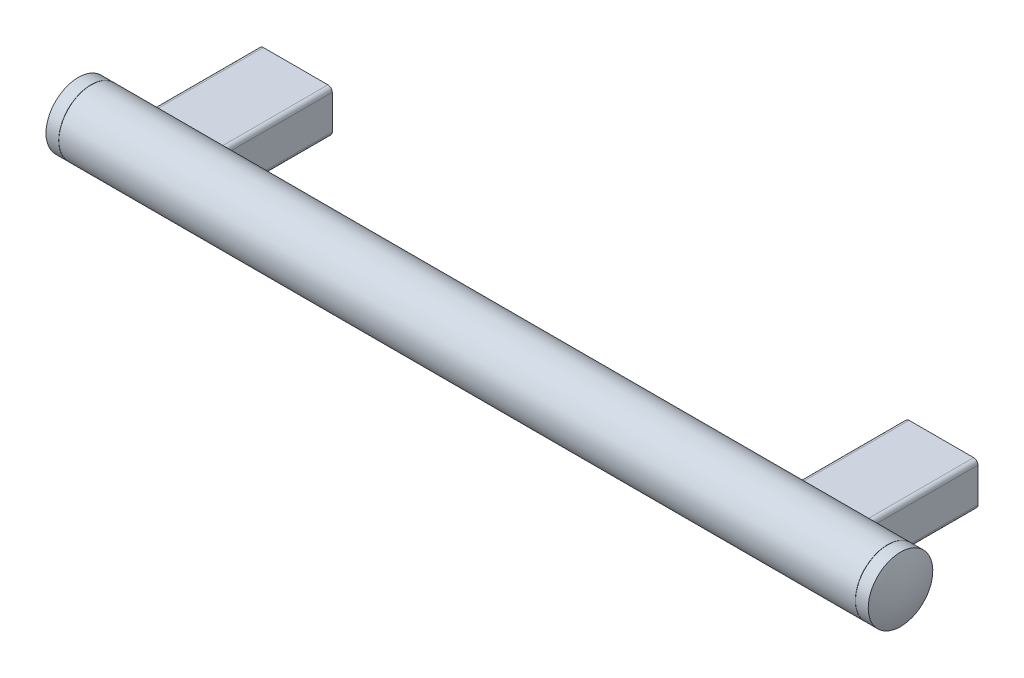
ISO-10303-21;
HEADER;
FILE_DESCRIPTION(('STEP AP214'),'2;1');
FILE_NAME('part.step','',(''),(''),'','','');
FILE_SCHEMA(('AUTOMOTIVE_DESIGN { 1 0 10303 214 1 1 1 1 }'));
ENDSEC;
DATA;
#1=APPLICATION_CONTEXT('core data for automotive mechanical design processes');
#2=APPLICATION_PROTOCOL_DEFINITION('international standard','automotive_design',2000,#1);
#3=PRODUCT_CONTEXT('',#1,'mechanical');
#4=PRODUCT('Part','Part','',(#3));
#5=PRODUCT_RELATED_PRODUCT_CATEGORY('part','',(#4));
#6=PRODUCT_DEFINITION_FORMATION('','',#4);
#7=PRODUCT_DEFINITION_CONTEXT('part definition',#1,'design');
#8=PRODUCT_DEFINITION('design','',#6,#7);
#9=PRODUCT_DEFINITION_SHAPE('','',#8);
#10=(LENGTH_UNIT() NAMED_UNIT(*) SI_UNIT(.MILLI.,.METRE.));
#11=(NAMED_UNIT(*) PLANE_ANGLE_UNIT() SI_UNIT($,.RADIAN.));
#12=(NAMED_UNIT(*) SI_UNIT($,.STERADIAN.) SOLID_ANGLE_UNIT());
#13=UNCERTAINTY_MEASURE_WITH_UNIT(LENGTH_MEASURE(1.E-05),#10,'distance_accuracy_value','');
#14=(GEOMETRIC_REPRESENTATION_CONTEXT(3) GLOBAL_UNCERTAINTY_ASSIGNED_CONTEXT((#13)) GLOBAL_UNIT_ASSIGNED_CONTEXT((#10,
#11,#12)) REPRESENTATION_CONTEXT('',''));
#15=CARTESIAN_POINT('',(0.,0.,0.));
#16=DIRECTION('',(0.,0.,1.));
#17=DIRECTION('',(1.,0.,0.));
#18=AXIS2_PLACEMENT_3D('',#15,#16,#17);
#19=CARTESIAN_POINT('',(0.,0.,17.));
#20=DIRECTION('',(0.,0.,-1.));
#21=DIRECTION('',(0.,1.,0.));
#22=AXIS2_PLACEMENT_3D('',#19,#20,#21);
#23=PLANE('',#22);
#24=CARTESIAN_POINT('',(0.,0.,17.));
#25=DIRECTION('',(0.,0.,-1.));
#26=DIRECTION('',(0.,1.,0.));
#27=AXIS2_PLACEMENT_3D('',#24,#25,#26);
#28=CIRCLE('',#27,3.);
#29=CARTESIAN_POINT('',(0.,3.,17.));
#30=VERTEX_POINT('',#29);
#31=EDGE_CURVE('E209',#30,#30,#28,.T.);
#32=ORIENTED_EDGE('',*,*,#31,.T.);
#33=EDGE_LOOP('',(#32));
#34=FACE_BOUND('',#33,.T.);
#35=ADVANCED_FACE('F14',(#34),#23,.T.);
#36=CARTESIAN_POINT('',(-5.,0.,60.));
#37=DIRECTION('',(1.,0.,0.));
#38=DIRECTION('',(0.,0.,1.));
#39=AXIS2_PLACEMENT_3D('',#36,#37,#38);
#40=SPHERICAL_SURFACE('',#39,39.);
#41=CARTESIAN_POINT('',(-41.,-2.69034686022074E-13,60.));
#42=DIRECTION('',(1.,0.,0.));
#43=DIRECTION('',(0.,1.,0.));
#44=AXIS2_PLACEMENT_3D('',#41,#42,#43);
#45=CIRCLE('',#44,15.);
#46=CARTESIAN_POINT('',(-41.0000000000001,14.9999999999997,60.));
#47=VERTEX_POINT('',#46);
#48=EDGE_CURVE('E322',#47,#47,#45,.T.);
#49=ORIENTED_EDGE('',*,*,#48,.F.);
#50=EDGE_LOOP('',(#49));
#51=FACE_BOUND('',#50,.T.);
#52=ADVANCED_FACE('F16',(#51),#40,.T.);
#53=CARTESIAN_POINT('',(0.,0.,17.));
#54=DIRECTION('',(0.,0.,-1.));
#55=DIRECTION('',(0.,1.,0.));
#56=AXIS2_PLACEMENT_3D('',#53,#54,#55);
#57=CYLINDRICAL_SURFACE('',#56,3.);
#58=ORIENTED_EDGE('',*,*,#31,.F.);
#59=EDGE_LOOP('',(#58));
#60=FACE_BOUND('',#59,.T.);
#61=CARTESIAN_POINT('',(0.,0.,0.));
#62=DIRECTION('',(0.,0.,-1.));
#63=DIRECTION('',(0.,1.,0.));
#64=AXIS2_PLACEMENT_3D('',#61,#62,#63);
#65=CIRCLE('',#64,3.);
#66=CARTESIAN_POINT('',(0.,3.,0.));
#67=VERTEX_POINT('',#66);
#68=EDGE_CURVE('E206',#67,#67,#65,.T.);
#69=ORIENTED_EDGE('',*,*,#68,.T.);
#70=EDGE_LOOP('',(#69));
#71=FACE_BOUND('',#70,.T.);
#72=ADVANCED_FACE('F342',(#60,#71),#57,.F.);
#73=CARTESIAN_POINT('',(-35.,-2.27871649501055E-13,60.));
#74=DIRECTION('',(1.,0.,0.));
#75=DIRECTION('',(0.,1.,0.));
#76=AXIS2_PLACEMENT_3D('',#73,#74,#75);
#77=CYLINDRICAL_SURFACE('',#76,15.);
#78=CARTESIAN_POINT('',(-35.1,-2.28557700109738E-13,60.));
#79=DIRECTION('',(-1.,0.,0.));
#80=DIRECTION('',(0.,-1.,0.));
#81=AXIS2_PLACEMENT_3D('',#78,#79,#80);
#82=CIRCLE('',#81,15.);
#83=CARTESIAN_POINT('',(-35.0999999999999,-15.0000000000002,60.));
#84=VERTEX_POINT('',#83);
#85=EDGE_CURVE('E9',#84,#84,#82,.T.);
#86=ORIENTED_EDGE('',*,*,#85,.T.);
#87=EDGE_LOOP('',(#86));
#88=FACE_BOUND('',#87,.T.);
#89=ORIENTED_EDGE('',*,*,#48,.T.);
#90=EDGE_LOOP('',(#89));
#91=FACE_BOUND('',#90,.T.);
#92=ADVANCED_FACE('F332',(#88,#91),#77,.T.);
#93=CARTESIAN_POINT('',(15.,8.0000000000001,0.));
#94=DIRECTION('',(0.,0.,-1.));
#95=DIRECTION('',(1.,0.,0.));
#96=AXIS2_PLACEMENT_3D('',#93,#94,#95);
#97=PLANE('',#96);
#98=ORIENTED_EDGE('',*,*,#68,.F.);
#99=EDGE_LOOP('',(#98));
#100=FACE_BOUND('',#99,.T.);
#101=CARTESIAN_POINT('',(15.,8.0000000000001,0.));
#102=DIRECTION('',(0.,0.,-1.));
#103=DIRECTION('',(1.,0.,0.));
#104=AXIS2_PLACEMENT_3D('',#101,#102,#103);
#105=CIRCLE('',#104,2.);
#106=CARTESIAN_POINT('',(15.,10.,0.));
#107=VERTEX_POINT('',#106);
#108=CARTESIAN_POINT('',(17.,8.00000000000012,0.));
#109=VERTEX_POINT('',#108);
#110=EDGE_CURVE('E212',#107,#109,#105,.T.);
#111=ORIENTED_EDGE('',*,*,#110,.T.);
#112=DIRECTION('',(0.,-1.,0.));
#113=VECTOR('',#112,1.);
#114=CARTESIAN_POINT('',(17.,8.00000000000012,0.));
#115=LINE('',#114,#113);
#116=CARTESIAN_POINT('',(17.,-7.99999999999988,0.));
#117=VERTEX_POINT('',#116);
#118=EDGE_CURVE('E226',#109,#117,#115,.T.);
#119=ORIENTED_EDGE('',*,*,#118,.T.);
#120=CARTESIAN_POINT('',(15.,-7.9999999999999,0.));
#121=DIRECTION('',(0.,0.,-1.));
#122=DIRECTION('',(1.,0.,0.));
#123=AXIS2_PLACEMENT_3D('',#120,#121,#122);
#124=CIRCLE('',#123,2.);
#125=CARTESIAN_POINT('',(15.,-10.,0.));
#126=VERTEX_POINT('',#125);
#127=EDGE_CURVE('E224',#117,#126,#124,.T.);
#128=ORIENTED_EDGE('',*,*,#127,.T.);
#129=DIRECTION('',(-1.,0.,0.));
#130=VECTOR('',#129,1.);
#131=CARTESIAN_POINT('',(15.,-10.,0.));
#132=LINE('',#131,#130);
#133=CARTESIAN_POINT('',(-15.,-10.,0.));
#134=VERTEX_POINT('',#133);
#135=EDGE_CURVE('E222',#126,#134,#132,.T.);
#136=ORIENTED_EDGE('',*,*,#135,.T.);
#137=CARTESIAN_POINT('',(-15.,-8.0000000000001,0.));
#138=DIRECTION('',(0.,0.,-1.));
#139=DIRECTION('',(1.,0.,0.));
#140=AXIS2_PLACEMENT_3D('',#137,#138,#139);
#141=CIRCLE('',#140,2.);
#142=CARTESIAN_POINT('',(-17.,-8.00000000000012,0.));
#143=VERTEX_POINT('',#142);
#144=EDGE_CURVE('E220',#134,#143,#141,.T.);
#145=ORIENTED_EDGE('',*,*,#144,.T.);
#146=DIRECTION('',(0.,1.,0.));
#147=VECTOR('',#146,1.);
#148=CARTESIAN_POINT('',(-17.,-8.00000000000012,0.));
#149=LINE('',#148,#147);
#150=CARTESIAN_POINT('',(-17.,7.99999999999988,0.));
#151=VERTEX_POINT('',#150);
#152=EDGE_CURVE('E218',#143,#151,#149,.T.);
#153=ORIENTED_EDGE('',*,*,#152,.T.);
#154=CARTESIAN_POINT('',(-15.,7.9999999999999,0.));
#155=DIRECTION('',(0.,0.,-1.));
#156=DIRECTION('',(1.,0.,0.));
#157=AXIS2_PLACEMENT_3D('',#154,#155,#156);
#158=CIRCLE('',#157,2.);
#159=CARTESIAN_POINT('',(-15.,10.,0.));
#160=VERTEX_POINT('',#159);
#161=EDGE_CURVE('E216',#151,#160,#158,.T.);
#162=ORIENTED_EDGE('',*,*,#161,.T.);
#163=DIRECTION('',(1.,0.,0.));
#164=VECTOR('',#163,1.);
#165=CARTESIAN_POINT('',(-15.,10.,0.));
#166=LINE('',#165,#164);
#167=EDGE_CURVE('E213',#160,#107,#166,.T.);
#168=ORIENTED_EDGE('',*,*,#167,.T.);
#169=EDGE_LOOP('',(#111,#119,#128,#136,#145,#153,#162,#168));
#170=FACE_BOUND('',#169,.T.);
#171=ADVANCED_FACE('F330',(#100,#170),#97,.T.);
#172=CARTESIAN_POINT('',(-35.,-2.27871649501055E-13,60.));
#173=DIRECTION('',(-1.,0.,0.));
#174=DIRECTION('',(0.,-1.,0.));
#175=AXIS2_PLACEMENT_3D('',#172,#173,#174);
#176=CONICAL_SURFACE('',#175,14.9,0.785398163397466);
#177=ORIENTED_EDGE('',*,*,#85,.F.);
#178=EDGE_LOOP('',(#177));
#179=FACE_BOUND('',#178,.T.);
#180=CARTESIAN_POINT('',(-35.,-2.27871649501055E-13,60.));
#181=DIRECTION('',(-1.,0.,0.));
#182=DIRECTION('',(0.,-1.,0.));
#183=AXIS2_PLACEMENT_3D('',#180,#181,#182);
#184=CIRCLE('',#183,14.9);
#185=CARTESIAN_POINT('',(-34.9999999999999,-14.9000000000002,60.));
#186=VERTEX_POINT('',#185);
#187=EDGE_CURVE('E22',#186,#186,#184,.F.);
#188=ORIENTED_EDGE('',*,*,#187,.F.);
#189=EDGE_LOOP('',(#188));
#190=FACE_BOUND('',#189,.T.);
#191=ADVANCED_FACE('F308',(#179,#190),#176,.T.);
#192=CARTESIAN_POINT('',(15.,-7.9999999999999,0.));
#193=DIRECTION('',(0.,0.,1.));
#194=DIRECTION('',(-1.,0.,0.));
#195=AXIS2_PLACEMENT_3D('',#192,#193,#194);
#196=CYLINDRICAL_SURFACE('',#195,2.);
#197=CARTESIAN_POINT('',(13.,-7.99999999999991,47.3114224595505));
#198=CARTESIAN_POINT('',(13.0000023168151,-8.14386139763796,47.4021308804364));
#199=CARTESIAN_POINT('',(13.0155259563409,-8.28625788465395,47.4953643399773));
#200=CARTESIAN_POINT('',(13.0758229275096,-8.56371074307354,47.6837058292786));
#201=CARTESIAN_POINT('',(13.1206564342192,-8.69875139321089,47.7788173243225));
#202=CARTESIAN_POINT('',(13.2349554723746,-8.95003632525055,47.9617438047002));
#203=CARTESIAN_POINT('',(13.3028588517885,-9.06691465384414,48.0496641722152));
#204=CARTESIAN_POINT('',(13.4631357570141,-9.28706267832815,48.2199435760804));
#205=CARTESIAN_POINT('',(13.5554607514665,-9.39035876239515,48.3023132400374));
#206=CARTESIAN_POINT('',(13.7336841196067,-9.55123394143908,48.4336095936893));
#207=CARTESIAN_POINT('',(13.8135167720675,-9.6133331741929,48.4852566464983));
#208=CARTESIAN_POINT('',(13.9850088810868,-9.72635405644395,48.5805658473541));
#209=CARTESIAN_POINT('',(14.0766503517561,-9.77729239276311,48.624239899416));
#210=CARTESIAN_POINT('',(14.2529034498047,-9.85726234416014,48.6935123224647));
#211=CARTESIAN_POINT('',(14.3357376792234,-9.88859638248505,48.720955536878));
#212=CARTESIAN_POINT('',(14.507188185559,-9.94039558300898,48.766579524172));
#213=CARTESIAN_POINT('',(14.5958003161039,-9.96086844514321,48.7847668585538));
#214=CARTESIAN_POINT('',(14.7770635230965,-9.98966321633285,48.8104058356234));
#215=CARTESIAN_POINT('',(14.8697344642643,-9.9979163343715,48.8177966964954));
#216=CARTESIAN_POINT('',(15.0555138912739,-10.0013851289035,48.8208987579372));
#217=CARTESIAN_POINT('',(15.1486222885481,-9.99660333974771,48.8166122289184));
#218=CARTESIAN_POINT('',(15.3236977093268,-9.97542143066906,48.7977175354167));
#219=CARTESIAN_POINT('',(15.4059092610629,-9.96011451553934,48.7840808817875));
#220=CARTESIAN_POINT('',(15.5660895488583,-9.91999093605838,48.7485782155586));
#221=CARTESIAN_POINT('',(15.6440574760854,-9.89517246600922,48.7267106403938));
#222=CARTESIAN_POINT('',(15.7999821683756,-9.83508027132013,48.674237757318));
#223=CARTESIAN_POINT('',(15.8775130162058,-9.79916985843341,48.6431064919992));
#224=CARTESIAN_POINT('',(16.0253011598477,-9.71925283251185,48.5746377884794));
#225=CARTESIAN_POINT('',(16.0955525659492,-9.67523974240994,48.5372953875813));
#226=CARTESIAN_POINT('',(16.2620749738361,-9.55636990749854,48.4378021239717));
#227=CARTESIAN_POINT('',(16.353495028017,-9.47718432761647,48.3726678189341));
#228=CARTESIAN_POINT('',(16.518627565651,-9.30686163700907,48.2358889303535));
#229=CARTESIAN_POINT('',(16.5923103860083,-9.21570489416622,48.1642337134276));
#230=CARTESIAN_POINT('',(16.7227715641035,-9.02265032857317,48.0163959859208));
#231=CARTESIAN_POINT('',(16.7792895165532,-8.9206160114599,47.940162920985));
#232=CARTESIAN_POINT('',(16.8736458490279,-8.70912728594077,47.7865564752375));
#233=CARTESIAN_POINT('',(16.9114866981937,-8.5996738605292,47.7091832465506));
#234=CARTESIAN_POINT('',(16.9722292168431,-8.35796248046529,47.543311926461));
#235=CARTESIAN_POINT('',(16.9919212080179,-8.22479320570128,47.4549411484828));
#236=CARTESIAN_POINT('',(17.0040509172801,-7.95466925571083,47.2819435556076));
#237=CARTESIAN_POINT('',(16.9964773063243,-7.81771303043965,47.1973183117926));
#238=CARTESIAN_POINT('',(16.9529013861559,-7.5479211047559,47.0364770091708));
#239=CARTESIAN_POINT('',(16.9176078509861,-7.4150673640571,46.960104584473));
#240=CARTESIAN_POINT('',(16.8182830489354,-7.15555538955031,46.8159187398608));
#241=CARTESIAN_POINT('',(16.7542827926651,-7.02889063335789,46.7480961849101));
#242=CARTESIAN_POINT('',(16.6077870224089,-6.80389422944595,46.631341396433));
#243=CARTESIAN_POINT('',(16.5287203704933,-6.70401274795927,46.5811018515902));
#244=CARTESIAN_POINT('',(16.3502883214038,-6.51906286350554,46.4902837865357));
#245=CARTESIAN_POINT('',(16.2509443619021,-6.43397899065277,46.449695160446));
#246=CARTESIAN_POINT('',(16.0496639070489,-6.29378739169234,46.3840743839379));
#247=CARTESIAN_POINT('',(15.9499072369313,-6.23617899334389,46.3576788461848));
#248=CARTESIAN_POINT('',(15.7404007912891,-6.13851290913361,46.3134536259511));
#249=CARTESIAN_POINT('',(15.6306571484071,-6.09844453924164,46.2956187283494));
#250=CARTESIAN_POINT('',(15.4147576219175,-6.04056991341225,46.2700171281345));
#251=CARTESIAN_POINT('',(15.3091262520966,-6.0211242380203,46.2615068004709));
#252=CARTESIAN_POINT('',(15.0957874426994,-5.99942292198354,46.2520156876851));
#253=CARTESIAN_POINT('',(14.9880805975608,-5.99716243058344,46.2510327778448));
#254=CARTESIAN_POINT('',(14.7777746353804,-6.00969461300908,46.2565067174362));
#255=CARTESIAN_POINT('',(14.6751312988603,-6.02387585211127,46.2626968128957));
#256=CARTESIAN_POINT('',(14.4738867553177,-6.06769355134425,46.281994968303));
#257=CARTESIAN_POINT('',(14.3752853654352,-6.09732931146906,46.2951027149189));
#258=CARTESIAN_POINT('',(14.1842523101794,-6.1710398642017,46.3281349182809));
#259=CARTESIAN_POINT('',(14.0918564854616,-6.21519107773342,46.3480954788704));
#260=CARTESIAN_POINT('',(13.9160688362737,-6.3161436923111,46.3945082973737));
#261=CARTESIAN_POINT('',(13.8326780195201,-6.37294650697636,46.4209612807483));
#262=CARTESIAN_POINT('',(13.6732429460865,-6.49982014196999,46.481218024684));
#263=CARTESIAN_POINT('',(13.5976745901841,-6.57035979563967,46.5152909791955));
#264=CARTESIAN_POINT('',(13.4595254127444,-6.72041002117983,46.5894410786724));
#265=CARTESIAN_POINT('',(13.3969495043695,-6.79992396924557,46.6295204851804));
#266=CARTESIAN_POINT('',(13.2808729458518,-6.97225102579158,46.7185142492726));
#267=CARTESIAN_POINT('',(13.2285510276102,-7.06562015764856,46.7678851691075));
#268=CARTESIAN_POINT('',(13.1401606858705,-7.25695759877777,46.8718461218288));
#269=CARTESIAN_POINT('',(13.1040923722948,-7.35492593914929,46.9264361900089));
#270=CARTESIAN_POINT('',(13.0503538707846,-7.54425766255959,47.0348536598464));
#271=CARTESIAN_POINT('',(13.0313508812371,-7.63544968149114,47.08833048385));
#272=CARTESIAN_POINT('',(13.0061708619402,-7.81795534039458,47.1980102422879));
#273=CARTESIAN_POINT('',(12.9999985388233,-7.90926901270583,47.2542141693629));
#274=CARTESIAN_POINT('',(13.,-7.99999999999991,47.3114224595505));
#275=B_SPLINE_CURVE_WITH_KNOTS('',3,(#197,#198,#199,#200,#201,#202,#203,#204,#205,#206,#207,
#208,#209,#210,#211,#212,#213,#214,#215,#216,#217,#218,#219,#220,#221,#222,#223,#224,#225,#226,
#227,#228,#229,#230,#231,#232,#233,#234,#235,#236,#237,#238,#239,#240,#241,#242,#243,#244,#245,
#246,#247,#248,#249,#250,#251,#252,#253,#254,#255,#256,#257,#258,#259,#260,#261,#262,#263,#264,
#265,#266,#267,#268,#269,#270,#271,#272,#273,#274),.UNSPECIFIED.,.T.,.F.,(4,2,2,2,2,2,2,2,2,2,2,
2,2,2,2,2,2,2,2,2,2,2,2,2,2,2,2,2,2,2,2,2,2,2,2,2,2,2,4),(0.,0.50977099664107,1.02059188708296,
1.50208208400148,1.98262254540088,2.32213593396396,2.66113819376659,2.93816857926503,
3.21500230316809,3.4933886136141,3.77172080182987,4.02480636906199,4.27794000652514,
4.54976470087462,4.82180763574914,5.23168501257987,5.6422431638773,6.05875006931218,
6.47520189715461,6.95596901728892,7.43693592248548,7.90599013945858,8.37453887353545,
8.78294034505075,9.19091226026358,9.54354102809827,9.89595470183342,10.2175724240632,
10.5390993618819,10.8490427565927,11.1589721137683,11.4705600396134,11.7821827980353,
12.1073297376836,12.4325994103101,12.7847727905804,13.1369485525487,13.4583347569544,
13.7798388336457),.UNSPECIFIED.);
#276=CARTESIAN_POINT('',(15.,-10.,48.819660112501));
#277=VERTEX_POINT('',#276);
#278=CARTESIAN_POINT('',(17.,-7.99999999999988,47.3114224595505));
#279=VERTEX_POINT('',#278);
#280=EDGE_CURVE('E296',#277,#279,#275,.T.);
#281=ORIENTED_EDGE('',*,*,#280,.F.);
#282=DIRECTION('',(0.,0.,1.));
#283=VECTOR('',#282,1.);
#284=CARTESIAN_POINT('',(15.,-10.,0.));
#285=LINE('',#284,#283);
#286=EDGE_CURVE('E236',#126,#277,#285,.T.);
#287=ORIENTED_EDGE('',*,*,#286,.F.);
#288=ORIENTED_EDGE('',*,*,#127,.F.);
#289=DIRECTION('',(0.,0.,1.));
#290=VECTOR('',#289,1.);
#291=CARTESIAN_POINT('',(17.,-7.99999999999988,0.));
#292=LINE('',#291,#290);
#293=EDGE_CURVE('E233',#117,#279,#292,.T.);
#294=ORIENTED_EDGE('',*,*,#293,.T.);
#295=EDGE_LOOP('',(#281,#287,#288,#294));
#296=FACE_BOUND('',#295,.T.);
#297=ADVANCED_FACE('F304',(#296),#196,.T.);
#298=CARTESIAN_POINT('',(15.,-10.,0.));
#299=DIRECTION('',(0.,1.,0.));
#300=DIRECTION('',(1.,0.,0.));
#301=AXIS2_PLACEMENT_3D('',#298,#299,#300);
#302=PLANE('',#301);
#303=DIRECTION('',(1.,0.,0.));
#304=VECTOR('',#303,1.);
#305=CARTESIAN_POINT('',(-35.,-10.0000000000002,48.819660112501));
#306=LINE('',#305,#304);
#307=CARTESIAN_POINT('',(-15.,-10.,48.8196601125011));
#308=VERTEX_POINT('',#307);
#309=EDGE_CURVE('E293',#308,#277,#306,.T.);
#310=ORIENTED_EDGE('',*,*,#309,.F.);
#311=DIRECTION('',(0.,0.,1.));
#312=VECTOR('',#311,1.);
#313=CARTESIAN_POINT('',(-15.,-10.,0.));
#314=LINE('',#313,#312);
#315=EDGE_CURVE('E239',#134,#308,#314,.T.);
#316=ORIENTED_EDGE('',*,*,#315,.F.);
#317=ORIENTED_EDGE('',*,*,#135,.F.);
#318=ORIENTED_EDGE('',*,*,#286,.T.);
#319=EDGE_LOOP('',(#310,#316,#317,#318));
#320=FACE_BOUND('',#319,.T.);
#321=ADVANCED_FACE('F284',(#320),#302,.F.);
#322=CARTESIAN_POINT('',(-15.,-8.0000000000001,0.));
#323=DIRECTION('',(0.,0.,1.));
#324=DIRECTION('',(-1.,0.,0.));
#325=AXIS2_PLACEMENT_3D('',#322,#323,#324);
#326=CYLINDRICAL_SURFACE('',#325,2.);
#327=CARTESIAN_POINT('',(-17.,-8.00000000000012,47.3114224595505));
#328=CARTESIAN_POINT('',(-16.9999976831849,-8.14386139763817,47.4021308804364));
#329=CARTESIAN_POINT('',(-16.9844740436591,-8.28625788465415,47.4953643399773));
#330=CARTESIAN_POINT('',(-16.9241770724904,-8.56371074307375,47.6837058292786));
#331=CARTESIAN_POINT('',(-16.8793435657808,-8.69875139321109,47.7788173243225));
#332=CARTESIAN_POINT('',(-16.7650445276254,-8.95003632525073,47.9617438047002));
#333=CARTESIAN_POINT('',(-16.6971411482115,-9.06691465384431,48.0496641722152));
#334=CARTESIAN_POINT('',(-16.5368642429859,-9.28706267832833,48.2199435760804));
#335=CARTESIAN_POINT('',(-16.4445392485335,-9.39035876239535,48.3023132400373));
#336=CARTESIAN_POINT('',(-16.2663158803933,-9.55123394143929,48.4336095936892));
#337=CARTESIAN_POINT('',(-16.1864832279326,-9.61333317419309,48.4852566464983));
#338=CARTESIAN_POINT('',(-16.0149911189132,-9.72635405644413,48.5805658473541));
#339=CARTESIAN_POINT('',(-15.9233496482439,-9.77729239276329,48.624239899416));
#340=CARTESIAN_POINT('',(-15.7470965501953,-9.85726234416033,48.6935123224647));
#341=CARTESIAN_POINT('',(-15.6642623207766,-9.88859638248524,48.720955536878));
#342=CARTESIAN_POINT('',(-15.492811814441,-9.94039558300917,48.7665795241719));
#343=CARTESIAN_POINT('',(-15.4041996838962,-9.96086844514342,48.7847668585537));
#344=CARTESIAN_POINT('',(-15.2229364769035,-9.98966321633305,48.8104058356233));
#345=CARTESIAN_POINT('',(-15.1302655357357,-9.9979163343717,48.8177966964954));
#346=CARTESIAN_POINT('',(-14.9444861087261,-10.0013851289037,48.8208987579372));
#347=CARTESIAN_POINT('',(-14.8513777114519,-9.99660333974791,48.8166122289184));
#348=CARTESIAN_POINT('',(-14.6763022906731,-9.97542143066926,48.7977175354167));
#349=CARTESIAN_POINT('',(-14.5940907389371,-9.96011451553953,48.7840808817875));
#350=CARTESIAN_POINT('',(-14.4339104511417,-9.91999093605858,48.7485782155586));
#351=CARTESIAN_POINT('',(-14.3559425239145,-9.89517246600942,48.7267106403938));
#352=CARTESIAN_POINT('',(-14.2000178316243,-9.83508027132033,48.674237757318));
#353=CARTESIAN_POINT('',(-14.1224869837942,-9.7991698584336,48.6431064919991));
#354=CARTESIAN_POINT('',(-13.9746988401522,-9.71925283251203,48.5746377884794));
#355=CARTESIAN_POINT('',(-13.9044474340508,-9.67523974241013,48.5372953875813));
#356=CARTESIAN_POINT('',(-13.7379250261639,-9.55636990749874,48.4378021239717));
#357=CARTESIAN_POINT('',(-13.646504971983,-9.47718432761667,48.3726678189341));
#358=CARTESIAN_POINT('',(-13.481372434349,-9.30686163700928,48.2358889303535));
#359=CARTESIAN_POINT('',(-13.4076896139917,-9.21570489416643,48.1642337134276));
#360=CARTESIAN_POINT('',(-13.2772284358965,-9.02265032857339,48.0163959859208));
#361=CARTESIAN_POINT('',(-13.2207104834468,-8.92061601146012,47.9401629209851));
#362=CARTESIAN_POINT('',(-13.1263541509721,-8.70912728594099,47.7865564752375));
#363=CARTESIAN_POINT('',(-13.0885133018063,-8.59967386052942,47.7091832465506));
#364=CARTESIAN_POINT('',(-13.0277707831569,-8.35796248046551,47.543311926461));
#365=CARTESIAN_POINT('',(-13.0080787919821,-8.2247932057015,47.4549411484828));
#366=CARTESIAN_POINT('',(-12.9959490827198,-7.95466925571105,47.2819435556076));
#367=CARTESIAN_POINT('',(-13.0035226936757,-7.81771303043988,47.1973183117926));
#368=CARTESIAN_POINT('',(-13.0470986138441,-7.54792110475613,47.0364770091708));
#369=CARTESIAN_POINT('',(-13.0823921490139,-7.41506736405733,46.960104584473));
#370=CARTESIAN_POINT('',(-13.1817169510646,-7.15555538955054,46.8159187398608));
#371=CARTESIAN_POINT('',(-13.2457172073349,-7.02889063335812,46.7480961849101));
#372=CARTESIAN_POINT('',(-13.392212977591,-6.80389422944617,46.631341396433));
#373=CARTESIAN_POINT('',(-13.4712796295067,-6.70401274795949,46.5811018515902));
#374=CARTESIAN_POINT('',(-13.6497116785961,-6.51906286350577,46.4902837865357));
#375=CARTESIAN_POINT('',(-13.7490556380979,-6.433978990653,46.449695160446));
#376=CARTESIAN_POINT('',(-13.950336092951,-6.29378739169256,46.3840743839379));
#377=CARTESIAN_POINT('',(-14.0500927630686,-6.23617899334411,46.3576788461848));
#378=CARTESIAN_POINT('',(-14.2595992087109,-6.13851290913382,46.3134536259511));
#379=CARTESIAN_POINT('',(-14.3693428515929,-6.09844453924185,46.2956187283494));
#380=CARTESIAN_POINT('',(-14.5852423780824,-6.04056991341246,46.2700171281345));
#381=CARTESIAN_POINT('',(-14.6908737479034,-6.02112423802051,46.2615068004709));
#382=CARTESIAN_POINT('',(-14.9042125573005,-5.99942292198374,46.2520156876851));
#383=CARTESIAN_POINT('',(-15.0119194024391,-5.99716243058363,46.2510327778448));
#384=CARTESIAN_POINT('',(-15.2222253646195,-6.00969461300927,46.2565067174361));
#385=CARTESIAN_POINT('',(-15.3248687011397,-6.02387585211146,46.2626968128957));
#386=CARTESIAN_POINT('',(-15.5261132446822,-6.06769355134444,46.281994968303));
#387=CARTESIAN_POINT('',(-15.6247146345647,-6.09732931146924,46.2951027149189));
#388=CARTESIAN_POINT('',(-15.8157476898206,-6.17103986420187,46.3281349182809));
#389=CARTESIAN_POINT('',(-15.9081435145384,-6.21519107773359,46.3480954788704));
#390=CARTESIAN_POINT('',(-16.0839311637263,-6.31614369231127,46.3945082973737));
#391=CARTESIAN_POINT('',(-16.1673219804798,-6.37294650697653,46.4209612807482));
#392=CARTESIAN_POINT('',(-16.3267570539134,-6.49982014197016,46.4812180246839));
#393=CARTESIAN_POINT('',(-16.4023254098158,-6.57035979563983,46.5152909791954));
#394=CARTESIAN_POINT('',(-16.5404745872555,-6.72041002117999,46.5894410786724));
#395=CARTESIAN_POINT('',(-16.6030504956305,-6.79992396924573,46.6295204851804));
#396=CARTESIAN_POINT('',(-16.7191270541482,-6.97225102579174,46.7185142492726));
#397=CARTESIAN_POINT('',(-16.7714489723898,-7.06562015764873,46.7678851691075));
#398=CARTESIAN_POINT('',(-16.8598393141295,-7.25695759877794,46.8718461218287));
#399=CARTESIAN_POINT('',(-16.8959076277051,-7.35492593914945,46.9264361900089));
#400=CARTESIAN_POINT('',(-16.9496461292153,-7.54425766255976,47.0348536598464));
#401=CARTESIAN_POINT('',(-16.9686491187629,-7.63544968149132,47.08833048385));
#402=CARTESIAN_POINT('',(-16.9938291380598,-7.81795534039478,47.1980102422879));
#403=CARTESIAN_POINT('',(-17.0000014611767,-7.90926901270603,47.2542141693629));
#404=CARTESIAN_POINT('',(-17.,-8.00000000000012,47.3114224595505));
#405=B_SPLINE_CURVE_WITH_KNOTS('',3,(#327,#328,#329,#330,#331,#332,#333,#334,#335,#336,#337,
#338,#339,#340,#341,#342,#343,#344,#345,#346,#347,#348,#349,#350,#351,#352,#353,#354,#355,#356,
#357,#358,#359,#360,#361,#362,#363,#364,#365,#366,#367,#368,#369,#370,#371,#372,#373,#374,#375,
#376,#377,#378,#379,#380,#381,#382,#383,#384,#385,#386,#387,#388,#389,#390,#391,#392,#393,#394,
#395,#396,#397,#398,#399,#400,#401,#402,#403,#404),.UNSPECIFIED.,.T.,.F.,(4,2,2,2,2,2,2,2,2,2,2,
2,2,2,2,2,2,2,2,2,2,2,2,2,2,2,2,2,2,2,2,2,2,2,2,2,2,2,4),(0.,0.509770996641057,1.02059188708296,
1.50208208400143,1.98262254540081,2.32213593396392,2.66113819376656,2.93816857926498,
3.21500230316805,3.49338861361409,3.77172080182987,4.024806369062,4.27794000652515,
4.54976470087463,4.82180763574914,5.23168501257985,5.64224316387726,6.05875006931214,
6.47520189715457,6.95596901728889,7.43693592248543,7.90599013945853,8.37453887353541,
8.78294034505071,9.19091226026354,9.54354102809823,9.89595470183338,10.2175724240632,
10.5390993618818,10.8490427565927,11.1589721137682,11.4705600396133,11.7821827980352,
12.1073297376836,12.4325994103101,12.7847727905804,13.1369485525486,13.4583347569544,
13.7798388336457),.UNSPECIFIED.);
#406=CARTESIAN_POINT('',(-17.,-8.00000000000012,47.3114224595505));
#407=VERTEX_POINT('',#406);
#408=EDGE_CURVE('E287',#407,#308,#405,.T.);
#409=ORIENTED_EDGE('',*,*,#408,.F.);
#410=DIRECTION('',(0.,0.,1.));
#411=VECTOR('',#410,1.);
#412=CARTESIAN_POINT('',(-17.,-8.00000000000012,0.));
#413=LINE('',#412,#411);
#414=EDGE_CURVE('E242',#143,#407,#413,.T.);
#415=ORIENTED_EDGE('',*,*,#414,.F.);
#416=ORIENTED_EDGE('',*,*,#144,.F.);
#417=ORIENTED_EDGE('',*,*,#315,.T.);
#418=EDGE_LOOP('',(#409,#415,#416,#417));
#419=FACE_BOUND('',#418,.T.);
#420=ADVANCED_FACE('F279',(#419),#326,.T.);
#421=CARTESIAN_POINT('',(-17.,-8.00000000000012,0.));
#422=DIRECTION('',(1.,0.,0.));
#423=DIRECTION('',(0.,0.,1.));
#424=AXIS2_PLACEMENT_3D('',#421,#422,#423);
#425=PLANE('',#424);
#426=CARTESIAN_POINT('',(-17.,-1.18710434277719E-13,60.));
#427=DIRECTION('',(1.,0.,0.));
#428=DIRECTION('',(0.,0.,1.));
#429=AXIS2_PLACEMENT_3D('',#426,#427,#428);
#430=CIRCLE('',#429,15.);
#431=CARTESIAN_POINT('',(-17.,7.99999999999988,47.3114224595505));
#432=VERTEX_POINT('',#431);
#433=EDGE_CURVE('E263',#432,#407,#430,.F.);
#434=ORIENTED_EDGE('',*,*,#433,.F.);
#435=DIRECTION('',(0.,0.,1.));
#436=VECTOR('',#435,1.);
#437=CARTESIAN_POINT('',(-17.,7.99999999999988,0.));
#438=LINE('',#437,#436);
#439=EDGE_CURVE('E245',#151,#432,#438,.T.);
#440=ORIENTED_EDGE('',*,*,#439,.F.);
#441=ORIENTED_EDGE('',*,*,#152,.F.);
#442=ORIENTED_EDGE('',*,*,#414,.T.);
#443=EDGE_LOOP('',(#434,#440,#441,#442));
#444=FACE_BOUND('',#443,.T.);
#445=ADVANCED_FACE('F274',(#444),#425,.F.);
#446=CARTESIAN_POINT('',(-15.,7.9999999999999,0.));
#447=DIRECTION('',(0.,0.,1.));
#448=DIRECTION('',(-1.,0.,0.));
#449=AXIS2_PLACEMENT_3D('',#446,#447,#448);
#450=CYLINDRICAL_SURFACE('',#449,2.);
#451=CARTESIAN_POINT('',(-17.,7.99999999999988,47.3114224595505));
#452=CARTESIAN_POINT('',(-16.9999991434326,7.87909476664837,47.2351918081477));
#453=CARTESIAN_POINT('',(-16.9890388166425,7.75708923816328,47.1607041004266));
#454=CARTESIAN_POINT('',(-16.944013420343,7.51414460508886,47.0170299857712));
#455=CARTESIAN_POINT('',(-16.909954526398,7.39320522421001,46.9478421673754));
#456=CARTESIAN_POINT('',(-16.8175938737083,7.15580080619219,46.8161820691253));
#457=CARTESIAN_POINT('',(-16.7591388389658,7.03936923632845,46.7537554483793));
#458=CARTESIAN_POINT('',(-16.6180104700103,6.81706769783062,46.6379910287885));
#459=CARTESIAN_POINT('',(-16.5353548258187,6.71119009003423,46.5846466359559));
#460=CARTESIAN_POINT('',(-16.3589136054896,6.52774525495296,46.4945296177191));
#461=CARTESIAN_POINT('',(-16.2677073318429,6.44830074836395,46.4565302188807));
#462=CARTESIAN_POINT('',(-16.0701948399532,6.30605393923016,46.3897143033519));
#463=CARTESIAN_POINT('',(-15.9639012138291,6.24323788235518,46.3608901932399));
#464=CARTESIAN_POINT('',(-15.7525224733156,6.14371866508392,46.3157983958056));
#465=CARTESIAN_POINT('',(-15.6486727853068,6.10485920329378,46.298476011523));
#466=CARTESIAN_POINT('',(-15.4350253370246,6.04473842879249,46.2718452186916));
#467=CARTESIAN_POINT('',(-15.3252301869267,6.02346945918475,46.2625333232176));
#468=CARTESIAN_POINT('',(-15.1101174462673,6.00028628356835,46.2523925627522));
#469=CARTESIAN_POINT('',(-15.0049409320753,5.99726003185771,46.2510762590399));
#470=CARTESIAN_POINT('',(-14.795579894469,6.00771705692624,46.2556422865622));
#471=CARTESIAN_POINT('',(-14.6913952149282,6.02119769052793,46.2615234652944));
#472=CARTESIAN_POINT('',(-14.4886277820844,6.06374928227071,46.2802526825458));
#473=CARTESIAN_POINT('',(-14.3899832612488,6.09257556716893,46.2929914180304));
#474=CARTESIAN_POINT('',(-14.1992155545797,6.16447906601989,46.3251786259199));
#475=CARTESIAN_POINT('',(-14.1070926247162,6.20755683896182,46.3446273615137));
#476=CARTESIAN_POINT('',(-13.9295504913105,6.30744168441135,46.3904718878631));
#477=CARTESIAN_POINT('',(-13.8443382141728,6.36454602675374,46.417019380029));
#478=CARTESIAN_POINT('',(-13.6849200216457,6.48975291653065,46.4763947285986));
#479=CARTESIAN_POINT('',(-13.6107163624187,6.55785771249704,46.5092238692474));
#480=CARTESIAN_POINT('',(-13.4703450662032,6.7072135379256,46.5828236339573));
#481=CARTESIAN_POINT('',(-13.4049591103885,6.78901734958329,46.6239600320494));
#482=CARTESIAN_POINT('',(-13.288789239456,6.95960528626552,46.7119184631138));
#483=CARTESIAN_POINT('',(-13.2380106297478,7.04839193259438,46.7587425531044));
#484=CARTESIAN_POINT('',(-13.146904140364,7.23951560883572,46.8621785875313));
#485=CARTESIAN_POINT('',(-13.1081365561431,7.34231828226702,46.9193012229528));
#486=CARTESIAN_POINT('',(-13.0482089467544,7.55028832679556,47.0382283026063));
#487=CARTESIAN_POINT('',(-13.0270567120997,7.65545672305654,47.1000348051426));
#488=CARTESIAN_POINT('',(-13.0000866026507,7.87914859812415,47.2352758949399));
#489=CARTESIAN_POINT('',(-12.9965732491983,7.9976616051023,47.309187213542));
#490=CARTESIAN_POINT('',(-13.0100119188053,8.23176813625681,47.459768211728));
#491=CARTESIAN_POINT('',(-13.026978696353,8.34735949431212,47.5364398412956));
#492=CARTESIAN_POINT('',(-13.0835973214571,8.5867568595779,47.6999585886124));
#493=CARTESIAN_POINT('',(-13.1257113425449,8.70990049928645,47.786929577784));
#494=CARTESIAN_POINT('',(-13.2334577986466,8.9467076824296,47.9593245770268));
#495=CARTESIAN_POINT('',(-13.2990930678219,9.06037008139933,48.0447483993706));
#496=CARTESIAN_POINT('',(-13.4423655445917,9.25960123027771,48.1985889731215));
#497=CARTESIAN_POINT('',(-13.5169227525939,9.34685994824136,48.2676856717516));
#498=CARTESIAN_POINT('',(-13.6829377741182,9.50957472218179,48.3991861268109));
#499=CARTESIAN_POINT('',(-13.7743716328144,9.58504723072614,48.4615991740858));
#500=CARTESIAN_POINT('',(-13.9509067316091,9.70530243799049,48.5627005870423));
#501=CARTESIAN_POINT('',(-14.0326722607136,9.75315622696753,48.603550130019));
#502=CARTESIAN_POINT('',(-14.2053049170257,9.83784302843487,48.6765742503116));
#503=CARTESIAN_POINT('',(-14.296160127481,9.87469022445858,48.7087599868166));
#504=CARTESIAN_POINT('',(-14.4712701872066,9.9306990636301,48.758007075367));
#505=CARTESIAN_POINT('',(-14.554509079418,9.95167197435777,48.7766025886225));
#506=CARTESIAN_POINT('',(-14.7245244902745,9.98281750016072,48.8042955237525));
#507=CARTESIAN_POINT('',(-14.8112988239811,9.99299668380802,48.8133987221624));
#508=CARTESIAN_POINT('',(-14.9861247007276,10.0018703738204,48.8213315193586));
#509=CARTESIAN_POINT('',(-15.0741788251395,10.0005370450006,48.8201362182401));
#510=CARTESIAN_POINT('',(-15.2486141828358,9.98641726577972,48.8075224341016));
#511=CARTESIAN_POINT('',(-15.3349950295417,9.97362820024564,48.7961016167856));
#512=CARTESIAN_POINT('',(-15.5009447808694,9.93804813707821,48.7645323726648));
#513=CARTESIAN_POINT('',(-15.5806434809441,9.91559258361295,48.7446769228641));
#514=CARTESIAN_POINT('',(-15.7347280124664,9.86194601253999,48.6976421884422));
#515=CARTESIAN_POINT('',(-15.8091112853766,9.83075082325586,48.6704594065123));
#516=CARTESIAN_POINT('',(-15.9806238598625,9.74666189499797,48.5979492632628));
#517=CARTESIAN_POINT('',(-16.0747398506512,9.69009939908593,48.5497345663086));
#518=CARTESIAN_POINT('',(-16.2497262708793,9.56518206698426,48.4451760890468));
#519=CARTESIAN_POINT('',(-16.3305694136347,9.49680351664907,48.3888159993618));
#520=CARTESIAN_POINT('',(-16.497930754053,9.331678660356,48.2554817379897));
#521=CARTESIAN_POINT('',(-16.5804869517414,9.23217372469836,48.1769512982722));
#522=CARTESIAN_POINT('',(-16.7240153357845,9.02177052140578,48.0156229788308));
#523=CARTESIAN_POINT('',(-16.7849693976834,8.9108627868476,47.932821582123));
#524=CARTESIAN_POINT('',(-16.8890292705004,8.67085776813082,47.7590885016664));
#525=CARTESIAN_POINT('',(-16.9302441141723,8.54101472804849,47.6680503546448));
#526=CARTESIAN_POINT('',(-16.9857218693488,8.27458961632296,47.4877259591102));
#527=CARTESIAN_POINT('',(-17.0000009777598,8.13801164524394,47.3984386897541));
#528=CARTESIAN_POINT('',(-17.,7.99999999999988,47.3114224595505));
#529=B_SPLINE_CURVE_WITH_KNOTS('',3,(#451,#452,#453,#454,#455,#456,#457,#458,#459,#460,#461,
#462,#463,#464,#465,#466,#467,#468,#469,#470,#471,#472,#473,#474,#475,#476,#477,#478,#479,#480,
#481,#482,#483,#484,#485,#486,#487,#488,#489,#490,#491,#492,#493,#494,#495,#496,#497,#498,#499,
#500,#501,#502,#503,#504,#505,#506,#507,#508,#509,#510,#511,#512,#513,#514,#515,#516,#517,#518,
#519,#520,#521,#522,#523,#524,#525,#526,#527,#528),.UNSPECIFIED.,.T.,.F.,(4,2,2,2,2,2,2,2,2,2,2,
2,2,2,2,2,2,2,2,2,2,2,2,2,2,2,2,2,2,2,2,2,2,2,2,2,2,2,4),(0.,0.428302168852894,
0.856489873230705,1.28740928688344,1.71801449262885,2.09620696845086,2.47408563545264,
2.80902084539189,3.14381018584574,3.45796652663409,3.77207256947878,4.08131419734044,
4.39056795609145,4.70704747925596,5.02359177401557,5.35972890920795,5.69598797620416,
6.06599418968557,6.43616395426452,6.85362917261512,7.27139532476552,7.73894100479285,
8.206543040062,8.60695107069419,9.00679507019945,9.31517612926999,9.6231580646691,
9.88551744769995,10.1477170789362,10.4105508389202,10.6734446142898,10.9278702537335,
11.1824175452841,11.5402241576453,11.8987573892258,12.3502378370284,12.8020961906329,
13.2912914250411,13.7801924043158),.UNSPECIFIED.);
#530=CARTESIAN_POINT('',(-15.,10.,48.8196601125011));
#531=VERTEX_POINT('',#530);
#532=EDGE_CURVE('E255',#531,#432,#529,.T.);
#533=ORIENTED_EDGE('',*,*,#532,.F.);
#534=DIRECTION('',(0.,0.,1.));
#535=VECTOR('',#534,1.);
#536=CARTESIAN_POINT('',(-15.,10.,0.));
#537=LINE('',#536,#535);
#538=EDGE_CURVE('E29',#160,#531,#537,.T.);
#539=ORIENTED_EDGE('',*,*,#538,.F.);
#540=ORIENTED_EDGE('',*,*,#161,.F.);
#541=ORIENTED_EDGE('',*,*,#439,.T.);
#542=EDGE_LOOP('',(#533,#539,#540,#541));
#543=FACE_BOUND('',#542,.T.);
#544=ADVANCED_FACE('F268',(#543),#450,.T.);
#545=CARTESIAN_POINT('',(-15.,10.,0.));
#546=DIRECTION('',(0.,-1.,0.));
#547=DIRECTION('',(-1.,0.,0.));
#548=AXIS2_PLACEMENT_3D('',#545,#546,#547);
#549=PLANE('',#548);
#550=DIRECTION('',(1.,0.,0.));
#551=VECTOR('',#550,1.);
#552=CARTESIAN_POINT('',(-35.,9.99999999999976,48.8196601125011));
#553=LINE('',#552,#551);
#554=CARTESIAN_POINT('',(15.,10.,48.8196601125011));
#555=VERTEX_POINT('',#554);
#556=EDGE_CURVE('E252',#555,#531,#553,.F.);
#557=ORIENTED_EDGE('',*,*,#556,.F.);
#558=DIRECTION('',(0.,0.,1.));
#559=VECTOR('',#558,1.);
#560=CARTESIAN_POINT('',(15.,10.,0.));
#561=LINE('',#560,#559);
#562=EDGE_CURVE('E215',#107,#555,#561,.T.);
#563=ORIENTED_EDGE('',*,*,#562,.F.);
#564=ORIENTED_EDGE('',*,*,#167,.F.);
#565=ORIENTED_EDGE('',*,*,#538,.T.);
#566=EDGE_LOOP('',(#557,#563,#564,#565));
#567=FACE_BOUND('',#566,.T.);
#568=ADVANCED_FACE('F273',(#567),#549,.F.);
#569=CARTESIAN_POINT('',(15.,8.0000000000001,0.));
#570=DIRECTION('',(0.,0.,1.));
#571=DIRECTION('',(-1.,0.,0.));
#572=AXIS2_PLACEMENT_3D('',#569,#570,#571);
#573=CYLINDRICAL_SURFACE('',#572,2.);
#574=CARTESIAN_POINT('',(13.,8.00000000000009,47.3114224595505));
#575=CARTESIAN_POINT('',(13.0000008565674,7.87909476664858,47.2351918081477));
#576=CARTESIAN_POINT('',(13.0109611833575,7.75708923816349,47.1607041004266));
#577=CARTESIAN_POINT('',(13.055986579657,7.51414460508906,47.0170299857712));
#578=CARTESIAN_POINT('',(13.090045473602,7.39320522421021,46.9478421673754));
#579=CARTESIAN_POINT('',(13.1824061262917,7.15580080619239,46.8161820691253));
#580=CARTESIAN_POINT('',(13.2408611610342,7.03936923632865,46.7537554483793));
#581=CARTESIAN_POINT('',(13.3819895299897,6.81706769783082,46.6379910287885));
#582=CARTESIAN_POINT('',(13.4646451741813,6.71119009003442,46.5846466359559));
#583=CARTESIAN_POINT('',(13.6410863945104,6.52774525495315,46.4945296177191));
#584=CARTESIAN_POINT('',(13.7322926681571,6.44830074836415,46.4565302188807));
#585=CARTESIAN_POINT('',(13.9298051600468,6.30605393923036,46.3897143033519));
#586=CARTESIAN_POINT('',(14.0360987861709,6.24323788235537,46.3608901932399));
#587=CARTESIAN_POINT('',(14.2474775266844,6.14371866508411,46.3157983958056));
#588=CARTESIAN_POINT('',(14.3513272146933,6.10485920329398,46.298476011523));
#589=CARTESIAN_POINT('',(14.5649746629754,6.04473842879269,46.2718452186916));
#590=CARTESIAN_POINT('',(14.6747698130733,6.02346945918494,46.2625333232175));
#591=CARTESIAN_POINT('',(14.8898825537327,6.00028628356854,46.2523925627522));
#592=CARTESIAN_POINT('',(14.9950590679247,5.99726003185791,46.2510762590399));
#593=CARTESIAN_POINT('',(15.204420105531,6.00771705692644,46.2556422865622));
#594=CARTESIAN_POINT('',(15.3086047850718,6.02119769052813,46.2615234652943));
#595=CARTESIAN_POINT('',(15.5113722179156,6.06374928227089,46.2802526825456));
#596=CARTESIAN_POINT('',(15.6100167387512,6.09257556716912,46.2929914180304));
#597=CARTESIAN_POINT('',(15.8007844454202,6.16447906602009,46.3251786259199));
#598=CARTESIAN_POINT('',(15.8929073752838,6.20755683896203,46.3446273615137));
#599=CARTESIAN_POINT('',(16.0704495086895,6.30744168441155,46.3904718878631));
#600=CARTESIAN_POINT('',(16.1556617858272,6.36454602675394,46.417019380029));
#601=CARTESIAN_POINT('',(16.3150799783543,6.48975291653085,46.4763947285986));
#602=CARTESIAN_POINT('',(16.3892836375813,6.55785771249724,46.5092238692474));
#603=CARTESIAN_POINT('',(16.5296549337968,6.7072135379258,46.5828236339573));
#604=CARTESIAN_POINT('',(16.5950408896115,6.78901734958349,46.6239600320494));
#605=CARTESIAN_POINT('',(16.711210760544,6.95960528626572,46.7119184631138));
#606=CARTESIAN_POINT('',(16.7619893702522,7.04839193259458,46.7587425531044));
#607=CARTESIAN_POINT('',(16.853095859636,7.23951560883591,46.8621785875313));
#608=CARTESIAN_POINT('',(16.8918634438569,7.34231828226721,46.9193012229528));
#609=CARTESIAN_POINT('',(16.9517910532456,7.55028832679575,47.0382283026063));
#610=CARTESIAN_POINT('',(16.9729432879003,7.65545672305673,47.1000348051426));
#611=CARTESIAN_POINT('',(16.9999133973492,7.87914859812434,47.23527589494));
#612=CARTESIAN_POINT('',(17.0034267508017,7.9976616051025,47.309187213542));
#613=CARTESIAN_POINT('',(16.9899880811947,8.23176813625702,47.4597682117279));
#614=CARTESIAN_POINT('',(16.9730213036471,8.34735949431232,47.5364398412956));
#615=CARTESIAN_POINT('',(16.9164026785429,8.5867568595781,47.6999585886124));
#616=CARTESIAN_POINT('',(16.8742886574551,8.70990049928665,47.786929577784));
#617=CARTESIAN_POINT('',(16.7665422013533,8.94670768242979,47.9593245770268));
#618=CARTESIAN_POINT('',(16.7009069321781,9.06037008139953,48.0447483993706));
#619=CARTESIAN_POINT('',(16.5576344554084,9.2596012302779,48.1985889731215));
#620=CARTESIAN_POINT('',(16.4830772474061,9.34685994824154,48.2676856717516));
#621=CARTESIAN_POINT('',(16.3170622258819,9.50957472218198,48.3991861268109));
#622=CARTESIAN_POINT('',(16.2256283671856,9.58504723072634,48.4615991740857));
#623=CARTESIAN_POINT('',(16.0490932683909,9.7053024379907,48.5627005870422));
#624=CARTESIAN_POINT('',(15.9673277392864,9.75315622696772,48.603550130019));
#625=CARTESIAN_POINT('',(15.7946950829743,9.83784302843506,48.6765742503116));
#626=CARTESIAN_POINT('',(15.7038398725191,9.87469022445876,48.7087599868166));
#627=CARTESIAN_POINT('',(15.5287298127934,9.93069906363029,48.758007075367));
#628=CARTESIAN_POINT('',(15.445490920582,9.95167197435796,48.7766025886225));
#629=CARTESIAN_POINT('',(15.2754755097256,9.98281750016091,48.8042955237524));
#630=CARTESIAN_POINT('',(15.188701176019,9.99299668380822,48.8133987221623));
#631=CARTESIAN_POINT('',(15.0138752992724,10.0018703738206,48.8213315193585));
#632=CARTESIAN_POINT('',(14.9258211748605,10.0005370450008,48.8201362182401));
#633=CARTESIAN_POINT('',(14.7513858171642,9.98641726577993,48.8075224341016));
#634=CARTESIAN_POINT('',(14.6650049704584,9.97362820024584,48.7961016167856));
#635=CARTESIAN_POINT('',(14.4990552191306,9.93804813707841,48.7645323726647));
#636=CARTESIAN_POINT('',(14.4193565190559,9.91559258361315,48.7446769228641));
#637=CARTESIAN_POINT('',(14.2652719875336,9.86194601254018,48.6976421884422));
#638=CARTESIAN_POINT('',(14.1908887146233,9.83075082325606,48.6704594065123));
#639=CARTESIAN_POINT('',(14.0193761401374,9.74666189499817,48.5979492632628));
#640=CARTESIAN_POINT('',(13.9252601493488,9.69009939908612,48.5497345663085));
#641=CARTESIAN_POINT('',(13.7502737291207,9.56518206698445,48.4451760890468));
#642=CARTESIAN_POINT('',(13.6694305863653,9.49680351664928,48.3888159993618));
#643=CARTESIAN_POINT('',(13.5020692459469,9.33167866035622,48.2554817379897));
#644=CARTESIAN_POINT('',(13.4195130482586,9.23217372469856,48.1769512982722));
#645=CARTESIAN_POINT('',(13.2759846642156,9.02177052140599,48.0156229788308));
#646=CARTESIAN_POINT('',(13.2150306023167,8.91086278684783,47.932821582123));
#647=CARTESIAN_POINT('',(13.1109707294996,8.67085776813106,47.7590885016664));
#648=CARTESIAN_POINT('',(13.0697558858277,8.54101472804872,47.6680503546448));
#649=CARTESIAN_POINT('',(13.0142781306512,8.27458961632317,47.4877259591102));
#650=CARTESIAN_POINT('',(12.9999990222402,8.13801164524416,47.3984386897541));
#651=CARTESIAN_POINT('',(13.,8.00000000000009,47.3114224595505));
#652=B_SPLINE_CURVE_WITH_KNOTS('',3,(#574,#575,#576,#577,#578,#579,#580,#581,#582,#583,#584,
#585,#586,#587,#588,#589,#590,#591,#592,#593,#594,#595,#596,#597,#598,#599,#600,#601,#602,#603,
#604,#605,#606,#607,#608,#609,#610,#611,#612,#613,#614,#615,#616,#617,#618,#619,#620,#621,#622,
#623,#624,#625,#626,#627,#628,#629,#630,#631,#632,#633,#634,#635,#636,#637,#638,#639,#640,#641,
#642,#643,#644,#645,#646,#647,#648,#649,#650,#651),.UNSPECIFIED.,.T.,.F.,(4,2,2,2,2,2,2,2,2,2,2,
2,2,2,2,2,2,2,2,2,2,2,2,2,2,2,2,2,2,2,2,2,2,2,2,2,2,2,4),(0.,0.428302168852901,
0.856489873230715,1.28740928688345,1.71801449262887,2.09620696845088,2.47408563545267,
2.80902084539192,3.14381018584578,3.45796652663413,3.7720725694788,4.08131419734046,
4.39056795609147,4.70704747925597,5.0235917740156,5.35972890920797,5.69598797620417,
6.06599418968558,6.43616395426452,6.85362917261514,7.27139532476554,7.73894100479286,
8.20654304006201,8.60695107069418,9.00679507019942,9.31517612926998,9.6231580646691,
9.88551744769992,10.1477170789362,10.4105508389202,10.6734446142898,10.9278702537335,
11.1824175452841,11.5402241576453,11.8987573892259,12.3502378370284,12.8020961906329,
13.2912914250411,13.7801924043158),.UNSPECIFIED.);
#653=CARTESIAN_POINT('',(17.,8.00000000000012,47.3114224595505));
#654=VERTEX_POINT('',#653);
#655=EDGE_CURVE('E37',#654,#555,#652,.T.);
#656=ORIENTED_EDGE('',*,*,#655,.F.);
#657=DIRECTION('',(0.,0.,1.));
#658=VECTOR('',#657,1.);
#659=CARTESIAN_POINT('',(17.,8.00000000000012,0.));
#660=LINE('',#659,#658);
#661=EDGE_CURVE('E230',#109,#654,#660,.T.);
#662=ORIENTED_EDGE('',*,*,#661,.F.);
#663=ORIENTED_EDGE('',*,*,#110,.F.);
#664=ORIENTED_EDGE('',*,*,#562,.T.);
#665=EDGE_LOOP('',(#656,#662,#663,#664));
#666=FACE_BOUND('',#665,.T.);
#667=ADVANCED_FACE('F314',(#666),#573,.T.);
#668=CARTESIAN_POINT('',(17.,8.00000000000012,0.));
#669=DIRECTION('',(-1.,0.,0.));
#670=DIRECTION('',(0.,0.,-1.));
#671=AXIS2_PLACEMENT_3D('',#668,#669,#670);
#672=PLANE('',#671);
#673=CARTESIAN_POINT('',(17.,1.18710434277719E-13,60.));
#674=DIRECTION('',(-1.,0.,0.));
#675=DIRECTION('',(0.,0.,-1.));
#676=AXIS2_PLACEMENT_3D('',#673,#674,#675);
#677=CIRCLE('',#676,15.);
#678=EDGE_CURVE('E302',#279,#654,#677,.F.);
#679=ORIENTED_EDGE('',*,*,#678,.F.);
#680=ORIENTED_EDGE('',*,*,#293,.F.);
#681=ORIENTED_EDGE('',*,*,#118,.F.);
#682=ORIENTED_EDGE('',*,*,#661,.T.);
#683=EDGE_LOOP('',(#679,#680,#681,#682));
#684=FACE_BOUND('',#683,.T.);
#685=ADVANCED_FACE('F310',(#684),#672,.F.);
#686=CARTESIAN_POINT('',(-35.,-2.44403835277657E-13,60.));
#687=DIRECTION('',(-1.,0.,0.));
#688=DIRECTION('',(0.,0.,-1.));
#689=AXIS2_PLACEMENT_3D('',#686,#687,#688);
#690=PLANE('',#689);
#691=ORIENTED_EDGE('',*,*,#187,.T.);
#692=EDGE_LOOP('',(#691));
#693=FACE_BOUND('',#692,.T.);
#694=CARTESIAN_POINT('',(-35.,-2.44403835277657E-13,60.));
#695=DIRECTION('',(1.,0.,0.));
#696=DIRECTION('',(0.,1.,0.));
#697=AXIS2_PLACEMENT_3D('',#694,#695,#696);
#698=CIRCLE('',#697,15.);
#699=CARTESIAN_POINT('',(-35.0000000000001,14.9999999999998,60.));
#700=VERTEX_POINT('',#699);
#701=EDGE_CURVE('E232',#700,#700,#698,.T.);
#702=ORIENTED_EDGE('',*,*,#701,.F.);
#703=EDGE_LOOP('',(#702));
#704=FACE_BOUND('',#703,.T.);
#705=ADVANCED_FACE('F313',(#693,#704),#690,.T.);
#706=CARTESIAN_POINT('',(-35.,-2.44403835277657E-13,60.));
#707=DIRECTION('',(1.,0.,0.));
#708=DIRECTION('',(0.,1.,0.));
#709=AXIS2_PLACEMENT_3D('',#706,#707,#708);
#710=CYLINDRICAL_SURFACE('',#709,15.);
#711=ORIENTED_EDGE('',*,*,#701,.T.);
#712=EDGE_LOOP('',(#711));
#713=FACE_BOUND('',#712,.T.);
#714=ORIENTED_EDGE('',*,*,#678,.T.);
#715=ORIENTED_EDGE('',*,*,#655,.T.);
#716=ORIENTED_EDGE('',*,*,#556,.T.);
#717=ORIENTED_EDGE('',*,*,#532,.T.);
#718=ORIENTED_EDGE('',*,*,#433,.T.);
#719=ORIENTED_EDGE('',*,*,#408,.T.);
#720=ORIENTED_EDGE('',*,*,#309,.T.);
#721=ORIENTED_EDGE('',*,*,#280,.T.);
#722=EDGE_LOOP('',(#714,#715,#716,#717,#718,#719,#720,#721));
#723=FACE_BOUND('',#722,.T.);
#724=CARTESIAN_POINT('',(335.,1.64099717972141E-12,60.));
#725=DIRECTION('',(-1.,0.,0.));
#726=DIRECTION('',(0.,1.,0.));
#727=AXIS2_PLACEMENT_3D('',#724,#725,#726);
#728=CIRCLE('',#727,15.);
#729=CARTESIAN_POINT('',(335.,15.0000000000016,60.));
#730=VERTEX_POINT('',#729);
#731=EDGE_CURVE('E156',#730,#730,#728,.T.);
#732=ORIENTED_EDGE('',*,*,#731,.T.);
#733=EDGE_LOOP('',(#732));
#734=FACE_BOUND('',#733,.T.);
#735=CARTESIAN_POINT('',(317.,1.51530377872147E-12,60.));
#736=DIRECTION('',(-1.,0.,0.));
#737=DIRECTION('',(0.,0.,-1.));
#738=AXIS2_PLACEMENT_3D('',#735,#736,#737);
#739=CIRCLE('',#738,15.);
#740=CARTESIAN_POINT('',(317.,-7.99999999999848,47.3114224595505));
#741=VERTEX_POINT('',#740);
#742=CARTESIAN_POINT('',(317.,8.00000000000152,47.3114224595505));
#743=VERTEX_POINT('',#742);
#744=EDGE_CURVE('E386',#741,#743,#739,.F.);
#745=ORIENTED_EDGE('',*,*,#744,.T.);
#746=CARTESIAN_POINT('',(313.,8.00000000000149,47.3114224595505));
#747=CARTESIAN_POINT('',(313.000000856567,7.87909476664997,47.2351918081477));
#748=CARTESIAN_POINT('',(313.010961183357,7.75708923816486,47.1607041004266));
#749=CARTESIAN_POINT('',(313.055986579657,7.51414460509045,47.0170299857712));
#750=CARTESIAN_POINT('',(313.090045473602,7.39320522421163,46.9478421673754));
#751=CARTESIAN_POINT('',(313.182406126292,7.1558008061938,46.8161820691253));
#752=CARTESIAN_POINT('',(313.240861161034,7.03936923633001,46.7537554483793));
#753=CARTESIAN_POINT('',(313.38198952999,6.81706769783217,46.6379910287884));
#754=CARTESIAN_POINT('',(313.464645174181,6.71119009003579,46.5846466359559));
#755=CARTESIAN_POINT('',(313.64108639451,6.52774525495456,46.4945296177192));
#756=CARTESIAN_POINT('',(313.732292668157,6.44830074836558,46.4565302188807));
#757=CARTESIAN_POINT('',(313.929805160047,6.30605393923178,46.3897143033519));
#758=CARTESIAN_POINT('',(314.036098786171,6.24323788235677,46.3608901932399));
#759=CARTESIAN_POINT('',(314.247477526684,6.14371866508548,46.3157983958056));
#760=CARTESIAN_POINT('',(314.351327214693,6.10485920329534,46.298476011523));
#761=CARTESIAN_POINT('',(314.564974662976,6.04473842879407,46.2718452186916));
#762=CARTESIAN_POINT('',(314.674769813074,6.02346945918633,46.2625333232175));
#763=CARTESIAN_POINT('',(314.889882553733,6.00028628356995,46.2523925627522));
#764=CARTESIAN_POINT('',(314.995059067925,5.99726003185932,46.2510762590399));
#765=CARTESIAN_POINT('',(315.204420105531,6.00771705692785,46.2556422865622));
#766=CARTESIAN_POINT('',(315.308604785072,6.02119769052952,46.2615234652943));
#767=CARTESIAN_POINT('',(315.511372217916,6.06374928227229,46.2802526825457));
#768=CARTESIAN_POINT('',(315.610016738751,6.09257556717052,46.2929914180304));
#769=CARTESIAN_POINT('',(315.80078444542,6.16447906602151,46.3251786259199));
#770=CARTESIAN_POINT('',(315.892907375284,6.20755683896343,46.3446273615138));
#771=CARTESIAN_POINT('',(316.07044950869,6.30744168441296,46.3904718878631));
#772=CARTESIAN_POINT('',(316.155661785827,6.36454602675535,46.417019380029));
#773=CARTESIAN_POINT('',(316.315079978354,6.48975291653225,46.4763947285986));
#774=CARTESIAN_POINT('',(316.389283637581,6.55785771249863,46.5092238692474));
#775=CARTESIAN_POINT('',(316.529654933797,6.70721353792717,46.5828236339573));
#776=CARTESIAN_POINT('',(316.595040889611,6.78901734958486,46.6239600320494));
#777=CARTESIAN_POINT('',(316.711210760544,6.95960528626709,46.7119184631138));
#778=CARTESIAN_POINT('',(316.761989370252,7.04839193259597,46.7587425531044));
#779=CARTESIAN_POINT('',(316.853095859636,7.23951560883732,46.8621785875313));
#780=CARTESIAN_POINT('',(316.891863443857,7.3423182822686,46.9193012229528));
#781=CARTESIAN_POINT('',(316.951791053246,7.55028832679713,47.0382283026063));
#782=CARTESIAN_POINT('',(316.9729432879,7.65545672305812,47.1000348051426));
#783=CARTESIAN_POINT('',(316.999913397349,7.87914859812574,47.2352758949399));
#784=CARTESIAN_POINT('',(317.003426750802,7.99766160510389,47.309187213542));
#785=CARTESIAN_POINT('',(316.989988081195,8.2317681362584,47.4597682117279));
#786=CARTESIAN_POINT('',(316.973021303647,8.34735949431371,47.5364398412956));
#787=CARTESIAN_POINT('',(316.916402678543,8.58675685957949,47.6999585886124));
#788=CARTESIAN_POINT('',(316.874288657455,8.70990049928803,47.786929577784));
#789=CARTESIAN_POINT('',(316.766542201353,8.94670768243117,47.9593245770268));
#790=CARTESIAN_POINT('',(316.700906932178,9.06037008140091,48.0447483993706));
#791=CARTESIAN_POINT('',(316.557634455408,9.25960123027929,48.1985889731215));
#792=CARTESIAN_POINT('',(316.483077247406,9.34685994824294,48.2676856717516));
#793=CARTESIAN_POINT('',(316.317062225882,9.50957472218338,48.3991861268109));
#794=CARTESIAN_POINT('',(316.225628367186,9.58504723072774,48.4615991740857));
#795=CARTESIAN_POINT('',(316.049093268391,9.70530243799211,48.5627005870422));
#796=CARTESIAN_POINT('',(315.967327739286,9.75315622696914,48.603550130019));
#797=CARTESIAN_POINT('',(315.794695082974,9.83784302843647,48.6765742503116));
#798=CARTESIAN_POINT('',(315.703839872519,9.87469022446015,48.7087599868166));
#799=CARTESIAN_POINT('',(315.528729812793,9.93069906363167,48.758007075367));
#800=CARTESIAN_POINT('',(315.445490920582,9.95167197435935,48.7766025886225));
#801=CARTESIAN_POINT('',(315.275475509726,9.98281750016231,48.8042955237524));
#802=CARTESIAN_POINT('',(315.188701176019,9.9929966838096,48.8133987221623));
#803=CARTESIAN_POINT('',(315.013875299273,10.001870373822,48.8213315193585));
#804=CARTESIAN_POINT('',(314.925821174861,10.0005370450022,48.8201362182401));
#805=CARTESIAN_POINT('',(314.751385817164,9.98641726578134,48.8075224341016));
#806=CARTESIAN_POINT('',(314.665004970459,9.97362820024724,48.7961016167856));
#807=CARTESIAN_POINT('',(314.499055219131,9.9380481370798,48.7645323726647));
#808=CARTESIAN_POINT('',(314.419356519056,9.91559258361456,48.7446769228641));
#809=CARTESIAN_POINT('',(314.265271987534,9.8619460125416,48.6976421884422));
#810=CARTESIAN_POINT('',(314.190888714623,9.83075082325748,48.6704594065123));
#811=CARTESIAN_POINT('',(314.019376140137,9.74666189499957,48.5979492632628));
#812=CARTESIAN_POINT('',(313.925260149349,9.69009939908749,48.5497345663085));
#813=CARTESIAN_POINT('',(313.750273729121,9.56518206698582,48.4451760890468));
#814=CARTESIAN_POINT('',(313.669430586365,9.49680351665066,48.3888159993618));
#815=CARTESIAN_POINT('',(313.502069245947,9.3316786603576,48.2554817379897));
#816=CARTESIAN_POINT('',(313.419513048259,9.23217372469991,48.1769512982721));
#817=CARTESIAN_POINT('',(313.275984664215,9.02177052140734,48.0156229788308));
#818=CARTESIAN_POINT('',(313.215030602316,8.91086278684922,47.932821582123));
#819=CARTESIAN_POINT('',(313.110970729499,8.67085776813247,47.7590885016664));
#820=CARTESIAN_POINT('',(313.069755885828,8.5410147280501,47.6680503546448));
#821=CARTESIAN_POINT('',(313.014278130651,8.27458961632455,47.4877259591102));
#822=CARTESIAN_POINT('',(312.99999902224,8.13801164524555,47.3984386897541));
#823=CARTESIAN_POINT('',(313.,8.00000000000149,47.3114224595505));
#824=B_SPLINE_CURVE_WITH_KNOTS('',3,(#746,#747,#748,#749,#750,#751,#752,#753,#754,#755,#756,
#757,#758,#759,#760,#761,#762,#763,#764,#765,#766,#767,#768,#769,#770,#771,#772,#773,#774,#775,
#776,#777,#778,#779,#780,#781,#782,#783,#784,#785,#786,#787,#788,#789,#790,#791,#792,#793,#794,
#795,#796,#797,#798,#799,#800,#801,#802,#803,#804,#805,#806,#807,#808,#809,#810,#811,#812,#813,
#814,#815,#816,#817,#818,#819,#820,#821,#822,#823),.UNSPECIFIED.,.T.,.F.,(4,2,2,2,2,2,2,2,2,2,2,
2,2,2,2,2,2,2,2,2,2,2,2,2,2,2,2,2,2,2,2,2,2,2,2,2,2,2,4),(0.,0.42830216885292,0.856489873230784,
1.28740928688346,1.71801449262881,2.09620696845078,2.47408563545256,2.80902084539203,
3.14381018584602,3.45796652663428,3.7720725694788,4.08131419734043,4.3905679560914,
4.70704747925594,5.02359177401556,5.3597289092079,5.69598797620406,6.06599418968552,
6.43616395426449,6.85362917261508,7.27139532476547,7.73894100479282,8.20654304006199,
8.60695107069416,9.00679507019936,9.31517612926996,9.62315806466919,9.88551744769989,
10.147717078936,10.4105508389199,10.6734446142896,10.9278702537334,11.1824175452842,
11.5402241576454,11.8987573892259,12.3502378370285,12.8020961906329,13.2912914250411,
13.7801924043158),.UNSPECIFIED.);
#825=CARTESIAN_POINT('',(315.,10.0000000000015,48.8196601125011));
#826=VERTEX_POINT('',#825);
#827=EDGE_CURVE('E155',#743,#826,#824,.T.);
#828=ORIENTED_EDGE('',*,*,#827,.T.);
#829=DIRECTION('',(1.,0.,0.));
#830=VECTOR('',#829,1.);
#831=CARTESIAN_POINT('',(65.,9.99999999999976,48.8196601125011));
#832=LINE('',#831,#830);
#833=CARTESIAN_POINT('',(285.,10.0000000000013,48.8196601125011));
#834=VERTEX_POINT('',#833);
#835=EDGE_CURVE('E135',#826,#834,#832,.F.);
#836=ORIENTED_EDGE('',*,*,#835,.T.);
#837=CARTESIAN_POINT('',(283.,8.00000000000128,47.3114224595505));
#838=CARTESIAN_POINT('',(283.000000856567,7.87909476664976,47.2351918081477));
#839=CARTESIAN_POINT('',(283.010961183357,7.75708923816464,47.1607041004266));
#840=CARTESIAN_POINT('',(283.055986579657,7.51414460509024,47.0170299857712));
#841=CARTESIAN_POINT('',(283.090045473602,7.39320522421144,46.9478421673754));
#842=CARTESIAN_POINT('',(283.182406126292,7.1558008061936,46.8161820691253));
#843=CARTESIAN_POINT('',(283.240861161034,7.0393692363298,46.7537554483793));
#844=CARTESIAN_POINT('',(283.38198952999,6.81706769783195,46.6379910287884));
#845=CARTESIAN_POINT('',(283.464645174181,6.7111900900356,46.5846466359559));
#846=CARTESIAN_POINT('',(283.64108639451,6.52774525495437,46.4945296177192));
#847=CARTESIAN_POINT('',(283.732292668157,6.44830074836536,46.4565302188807));
#848=CARTESIAN_POINT('',(283.929805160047,6.30605393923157,46.3897143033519));
#849=CARTESIAN_POINT('',(284.036098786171,6.24323788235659,46.3608901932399));
#850=CARTESIAN_POINT('',(284.247477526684,6.14371866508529,46.3157983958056));
#851=CARTESIAN_POINT('',(284.351327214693,6.10485920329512,46.298476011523));
#852=CARTESIAN_POINT('',(284.564974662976,6.04473842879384,46.2718452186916));
#853=CARTESIAN_POINT('',(284.674769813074,6.02346945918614,46.2625333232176));
#854=CARTESIAN_POINT('',(284.889882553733,6.00028628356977,46.2523925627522));
#855=CARTESIAN_POINT('',(284.995059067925,5.99726003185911,46.2510762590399));
#856=CARTESIAN_POINT('',(285.204420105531,6.00771705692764,46.2556422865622));
#857=CARTESIAN_POINT('',(285.308604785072,6.02119769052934,46.2615234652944));
#858=CARTESIAN_POINT('',(285.511372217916,6.06374928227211,46.2802526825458));
#859=CARTESIAN_POINT('',(285.610016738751,6.09257556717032,46.2929914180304));
#860=CARTESIAN_POINT('',(285.80078444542,6.1644790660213,46.3251786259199));
#861=CARTESIAN_POINT('',(285.892907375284,6.20755683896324,46.3446273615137));
#862=CARTESIAN_POINT('',(286.070449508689,6.30744168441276,46.3904718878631));
#863=CARTESIAN_POINT('',(286.155661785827,6.36454602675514,46.417019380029));
#864=CARTESIAN_POINT('',(286.315079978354,6.48975291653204,46.4763947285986));
#865=CARTESIAN_POINT('',(286.389283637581,6.55785771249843,46.5092238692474));
#866=CARTESIAN_POINT('',(286.529654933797,6.70721353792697,46.5828236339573));
#867=CARTESIAN_POINT('',(286.595040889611,6.78901734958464,46.6239600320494));
#868=CARTESIAN_POINT('',(286.711210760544,6.95960528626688,46.7119184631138));
#869=CARTESIAN_POINT('',(286.761989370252,7.04839193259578,46.7587425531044));
#870=CARTESIAN_POINT('',(286.853095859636,7.23951560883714,46.8621785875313));
#871=CARTESIAN_POINT('',(286.891863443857,7.34231828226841,46.9193012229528));
#872=CARTESIAN_POINT('',(286.951791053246,7.55028832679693,47.0382283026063));
#873=CARTESIAN_POINT('',(286.9729432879,7.65545672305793,47.1000348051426));
#874=CARTESIAN_POINT('',(286.999913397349,7.87914859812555,47.2352758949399));
#875=CARTESIAN_POINT('',(287.003426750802,7.99766160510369,47.309187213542));
#876=CARTESIAN_POINT('',(286.989988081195,8.23176813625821,47.459768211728));
#877=CARTESIAN_POINT('',(286.973021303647,8.34735949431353,47.5364398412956));
#878=CARTESIAN_POINT('',(286.916402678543,8.5867568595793,47.6999585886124));
#879=CARTESIAN_POINT('',(286.874288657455,8.70990049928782,47.786929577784));
#880=CARTESIAN_POINT('',(286.766542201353,8.94670768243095,47.9593245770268));
#881=CARTESIAN_POINT('',(286.700906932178,9.06037008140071,48.0447483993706));
#882=CARTESIAN_POINT('',(286.557634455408,9.25960123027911,48.1985889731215));
#883=CARTESIAN_POINT('',(286.483077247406,9.34685994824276,48.2676856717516));
#884=CARTESIAN_POINT('',(286.317062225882,9.50957472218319,48.3991861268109));
#885=CARTESIAN_POINT('',(286.225628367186,9.58504723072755,48.4615991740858));
#886=CARTESIAN_POINT('',(286.049093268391,9.7053024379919,48.5627005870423));
#887=CARTESIAN_POINT('',(285.967327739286,9.75315622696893,48.603550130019));
#888=CARTESIAN_POINT('',(285.794695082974,9.83784302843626,48.6765742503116));
#889=CARTESIAN_POINT('',(285.703839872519,9.87469022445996,48.7087599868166));
#890=CARTESIAN_POINT('',(285.528729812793,9.93069906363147,48.758007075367));
#891=CARTESIAN_POINT('',(285.445490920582,9.95167197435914,48.7766025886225));
#892=CARTESIAN_POINT('',(285.275475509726,9.9828175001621,48.8042955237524));
#893=CARTESIAN_POINT('',(285.188701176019,9.99299668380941,48.8133987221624));
#894=CARTESIAN_POINT('',(285.013875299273,10.0018703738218,48.8213315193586));
#895=CARTESIAN_POINT('',(284.925821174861,10.000537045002,48.8201362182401));
#896=CARTESIAN_POINT('',(284.751385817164,9.98641726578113,48.8075224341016));
#897=CARTESIAN_POINT('',(284.665004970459,9.97362820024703,48.7961016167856));
#898=CARTESIAN_POINT('',(284.499055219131,9.9380481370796,48.7645323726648));
#899=CARTESIAN_POINT('',(284.419356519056,9.91559258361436,48.7446769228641));
#900=CARTESIAN_POINT('',(284.265271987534,9.8619460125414,48.6976421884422));
#901=CARTESIAN_POINT('',(284.190888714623,9.83075082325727,48.6704594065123));
#902=CARTESIAN_POINT('',(284.019376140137,9.74666189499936,48.5979492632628));
#903=CARTESIAN_POINT('',(283.925260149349,9.69009939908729,48.5497345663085));
#904=CARTESIAN_POINT('',(283.750273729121,9.56518206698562,48.4451760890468));
#905=CARTESIAN_POINT('',(283.669430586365,9.49680351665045,48.3888159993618));
#906=CARTESIAN_POINT('',(283.502069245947,9.33167866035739,48.2554817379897));
#907=CARTESIAN_POINT('',(283.419513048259,9.23217372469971,48.1769512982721));
#908=CARTESIAN_POINT('',(283.275984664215,9.02177052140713,48.0156229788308));
#909=CARTESIAN_POINT('',(283.215030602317,8.91086278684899,47.932821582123));
#910=CARTESIAN_POINT('',(283.110970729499,8.67085776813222,47.7590885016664));
#911=CARTESIAN_POINT('',(283.069755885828,8.54101472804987,47.6680503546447));
#912=CARTESIAN_POINT('',(283.014278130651,8.27458961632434,47.4877259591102));
#913=CARTESIAN_POINT('',(282.99999902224,8.13801164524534,47.3984386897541));
#914=CARTESIAN_POINT('',(283.,8.00000000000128,47.3114224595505));
#915=B_SPLINE_CURVE_WITH_KNOTS('',3,(#837,#838,#839,#840,#841,#842,#843,#844,#845,#846,#847,
#848,#849,#850,#851,#852,#853,#854,#855,#856,#857,#858,#859,#860,#861,#862,#863,#864,#865,#866,
#867,#868,#869,#870,#871,#872,#873,#874,#875,#876,#877,#878,#879,#880,#881,#882,#883,#884,#885,
#886,#887,#888,#889,#890,#891,#892,#893,#894,#895,#896,#897,#898,#899,#900,#901,#902,#903,#904,
#905,#906,#907,#908,#909,#910,#911,#912,#913,#914),.UNSPECIFIED.,.T.,.F.,(4,2,2,2,2,2,2,2,2,2,2,
2,2,2,2,2,2,2,2,2,2,2,2,2,2,2,2,2,2,2,2,2,2,2,2,2,2,2,4),(0.,0.428302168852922,
0.856489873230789,1.28740928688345,1.71801449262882,2.09620696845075,2.47408563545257,
2.809020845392,3.14381018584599,3.45796652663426,3.77207256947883,4.08131419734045,
4.39056795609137,4.7070474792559,5.02359177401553,5.35972890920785,5.69598797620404,
6.06599418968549,6.43616395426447,6.85362917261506,7.27139532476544,7.73894100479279,
8.20654304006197,8.60695107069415,9.00679507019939,9.31517612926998,9.62315806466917,
9.88551744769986,10.1477170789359,10.4105508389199,10.6734446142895,10.9278702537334,
11.1824175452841,11.5402241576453,11.8987573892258,12.3502378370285,12.8020961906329,
13.2912914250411,13.7801924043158),.UNSPECIFIED.);
#916=CARTESIAN_POINT('',(283.,8.00000000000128,47.3114224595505));
#917=VERTEX_POINT('',#916);
#918=EDGE_CURVE('E145',#834,#917,#915,.T.);
#919=ORIENTED_EDGE('',*,*,#918,.T.);
#920=CARTESIAN_POINT('',(283.,1.27788291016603E-12,60.));
#921=DIRECTION('',(1.,0.,0.));
#922=DIRECTION('',(0.,0.,1.));
#923=AXIS2_PLACEMENT_3D('',#920,#921,#922);
#924=CIRCLE('',#923,15.);
#925=CARTESIAN_POINT('',(283.,-7.99999999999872,47.3114224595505));
#926=VERTEX_POINT('',#925);
#927=EDGE_CURVE('E150',#917,#926,#924,.F.);
#928=ORIENTED_EDGE('',*,*,#927,.T.);
#929=CARTESIAN_POINT('',(283.,-7.99999999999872,47.3114224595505));
#930=CARTESIAN_POINT('',(283.000002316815,-8.14386139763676,47.4021308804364));
#931=CARTESIAN_POINT('',(283.015525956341,-8.28625788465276,47.4953643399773));
#932=CARTESIAN_POINT('',(283.07582292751,-8.56371074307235,47.6837058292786));
#933=CARTESIAN_POINT('',(283.120656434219,-8.6987513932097,47.7788173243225));
#934=CARTESIAN_POINT('',(283.234955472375,-8.95003632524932,47.9617438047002));
#935=CARTESIAN_POINT('',(283.302858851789,-9.06691465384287,48.0496641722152));
#936=CARTESIAN_POINT('',(283.463135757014,-9.28706267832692,48.2199435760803));
#937=CARTESIAN_POINT('',(283.555460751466,-9.39035876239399,48.3023132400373));
#938=CARTESIAN_POINT('',(283.733684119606,-9.55123394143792,48.4336095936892));
#939=CARTESIAN_POINT('',(283.813516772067,-9.6133331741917,48.4852566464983));
#940=CARTESIAN_POINT('',(283.985008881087,-9.72635405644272,48.5805658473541));
#941=CARTESIAN_POINT('',(284.076650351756,-9.77729239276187,48.6242398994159));
#942=CARTESIAN_POINT('',(284.252903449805,-9.85726234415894,48.6935123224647));
#943=CARTESIAN_POINT('',(284.335737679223,-9.88859638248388,48.7209555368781));
#944=CARTESIAN_POINT('',(284.507188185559,-9.94039558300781,48.7665795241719));
#945=CARTESIAN_POINT('',(284.595800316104,-9.96086844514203,48.7847668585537));
#946=CARTESIAN_POINT('',(284.777063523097,-9.98966321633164,48.8104058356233));
#947=CARTESIAN_POINT('',(284.869734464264,-9.99791633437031,48.8177966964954));
#948=CARTESIAN_POINT('',(285.055513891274,-10.0013851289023,48.8208987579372));
#949=CARTESIAN_POINT('',(285.148622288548,-9.99660333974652,48.8166122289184));
#950=CARTESIAN_POINT('',(285.323697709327,-9.97542143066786,48.7977175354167));
#951=CARTESIAN_POINT('',(285.405909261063,-9.96011451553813,48.7840808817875));
#952=CARTESIAN_POINT('',(285.566089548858,-9.91999093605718,48.7485782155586));
#953=CARTESIAN_POINT('',(285.644057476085,-9.89517246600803,48.7267106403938));
#954=CARTESIAN_POINT('',(285.799982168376,-9.83508027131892,48.674237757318));
#955=CARTESIAN_POINT('',(285.877513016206,-9.79916985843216,48.6431064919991));
#956=CARTESIAN_POINT('',(286.025301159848,-9.71925283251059,48.5746377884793));
#957=CARTESIAN_POINT('',(286.095552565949,-9.67523974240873,48.5372953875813));
#958=CARTESIAN_POINT('',(286.262074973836,-9.55636990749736,48.4378021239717));
#959=CARTESIAN_POINT('',(286.353495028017,-9.47718432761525,48.372667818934));
#960=CARTESIAN_POINT('',(286.518627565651,-9.30686163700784,48.2358889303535));
#961=CARTESIAN_POINT('',(286.592310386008,-9.21570489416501,48.1642337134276));
#962=CARTESIAN_POINT('',(286.722771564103,-9.02265032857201,48.0163959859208));
#963=CARTESIAN_POINT('',(286.779289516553,-8.92061601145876,47.9401629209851));
#964=CARTESIAN_POINT('',(286.873645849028,-8.70912728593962,47.7865564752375));
#965=CARTESIAN_POINT('',(286.911486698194,-8.59967386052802,47.7091832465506));
#966=CARTESIAN_POINT('',(286.972229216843,-8.35796248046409,47.543311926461));
#967=CARTESIAN_POINT('',(286.991921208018,-8.2247932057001,47.4549411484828));
#968=CARTESIAN_POINT('',(287.00405091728,-7.95466925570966,47.2819435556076));
#969=CARTESIAN_POINT('',(286.996477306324,-7.8177130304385,47.1973183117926));
#970=CARTESIAN_POINT('',(286.952901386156,-7.54792110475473,47.0364770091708));
#971=CARTESIAN_POINT('',(286.917607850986,-7.41506736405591,46.960104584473));
#972=CARTESIAN_POINT('',(286.818283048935,-7.15555538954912,46.8159187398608));
#973=CARTESIAN_POINT('',(286.754282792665,-7.02889063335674,46.7480961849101));
#974=CARTESIAN_POINT('',(286.607787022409,-6.8038942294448,46.631341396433));
#975=CARTESIAN_POINT('',(286.528720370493,-6.7040127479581,46.5811018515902));
#976=CARTESIAN_POINT('',(286.350288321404,-6.51906286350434,46.4902837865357));
#977=CARTESIAN_POINT('',(286.250944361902,-6.43397899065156,46.449695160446));
#978=CARTESIAN_POINT('',(286.049663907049,-6.29378739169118,46.3840743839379));
#979=CARTESIAN_POINT('',(285.949907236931,-6.23617899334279,46.3576788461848));
#980=CARTESIAN_POINT('',(285.740400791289,-6.1385129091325,46.3134536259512));
#981=CARTESIAN_POINT('',(285.630657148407,-6.09844453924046,46.2956187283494));
#982=CARTESIAN_POINT('',(285.414757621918,-6.04056991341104,46.2700171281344));
#983=CARTESIAN_POINT('',(285.309126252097,-6.02112423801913,46.2615068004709));
#984=CARTESIAN_POINT('',(285.095787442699,-5.99942292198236,46.2520156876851));
#985=CARTESIAN_POINT('',(284.988080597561,-5.99716243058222,46.2510327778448));
#986=CARTESIAN_POINT('',(284.77777463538,-6.00969461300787,46.2565067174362));
#987=CARTESIAN_POINT('',(284.67513129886,-6.0238758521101,46.2626968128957));
#988=CARTESIAN_POINT('',(284.473886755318,-6.06769355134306,46.281994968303));
#989=CARTESIAN_POINT('',(284.375285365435,-6.09732931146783,46.2951027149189));
#990=CARTESIAN_POINT('',(284.184252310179,-6.17103986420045,46.3281349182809));
#991=CARTESIAN_POINT('',(284.091856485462,-6.2151910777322,46.3480954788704));
#992=CARTESIAN_POINT('',(283.916068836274,-6.31614369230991,46.3945082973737));
#993=CARTESIAN_POINT('',(283.83267801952,-6.37294650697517,46.4209612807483));
#994=CARTESIAN_POINT('',(283.673242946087,-6.49982014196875,46.4812180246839));
#995=CARTESIAN_POINT('',(283.597674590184,-6.57035979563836,46.5152909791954));
#996=CARTESIAN_POINT('',(283.459525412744,-6.72041002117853,46.5894410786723));
#997=CARTESIAN_POINT('',(283.39694950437,-6.79992396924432,46.6295204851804));
#998=CARTESIAN_POINT('',(283.280872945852,-6.97225102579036,46.7185142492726));
#999=CARTESIAN_POINT('',(283.22855102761,-7.06562015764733,46.7678851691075));
#1000=CARTESIAN_POINT('',(283.14016068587,-7.25695759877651,46.8718461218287));
#1001=CARTESIAN_POINT('',(283.104092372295,-7.35492593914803,46.9264361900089));
#1002=CARTESIAN_POINT('',(283.050353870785,-7.54425766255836,47.0348536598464));
#1003=CARTESIAN_POINT('',(283.031350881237,-7.63544968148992,47.08833048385));
#1004=CARTESIAN_POINT('',(283.00617086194,-7.81795534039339,47.1980102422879));
#1005=CARTESIAN_POINT('',(282.999998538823,-7.90926901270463,47.2542141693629));
#1006=CARTESIAN_POINT('',(283.,-7.99999999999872,47.3114224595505));
#1007=B_SPLINE_CURVE_WITH_KNOTS('',3,(#929,#930,#931,#932,#933,#934,#935,#936,#937,#938,#939,
#940,#941,#942,#943,#944,#945,#946,#947,#948,#949,#950,#951,#952,#953,#954,#955,#956,#957,#958,
#959,#960,#961,#962,#963,#964,#965,#966,#967,#968,#969,#970,#971,#972,#973,#974,#975,#976,#977,
#978,#979,#980,#981,#982,#983,#984,#985,#986,#987,#988,#989,#990,#991,#992,#993,#994,#995,#996,
#997,#998,#999,#1000,#1001,#1002,#1003,#1004,#1005,#1006),.UNSPECIFIED.,.T.,.F.,(4,2,2,2,2,2,2,
2,2,2,2,2,2,2,2,2,2,2,2,2,2,2,2,2,2,2,2,2,2,2,2,2,2,2,2,2,2,2,4),(0.,0.509770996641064,
1.02059188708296,1.5020820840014,1.98262254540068,2.32213593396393,2.6611381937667,
2.93816857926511,3.21500230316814,3.4933886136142,3.77172080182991,4.02480636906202,
4.27794000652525,4.54976470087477,4.82180763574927,5.23168501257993,5.64224316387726,
6.05875006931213,6.47520189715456,6.95596901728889,7.43693592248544,7.90599013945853,
8.37453887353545,8.7829403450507,9.1909122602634,9.54354102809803,9.89595470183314,
10.2175724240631,10.5390993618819,10.8490427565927,11.1589721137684,11.4705600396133,
11.7821827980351,12.1073297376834,12.43259941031,12.7847727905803,13.1369485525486,
13.4583347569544,13.7798388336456),.UNSPECIFIED.);
#1008=CARTESIAN_POINT('',(285.,-9.99999999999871,48.8196601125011));
#1009=VERTEX_POINT('',#1008);
#1010=EDGE_CURVE('E405',#926,#1009,#1007,.T.);
#1011=ORIENTED_EDGE('',*,*,#1010,.T.);
#1012=DIRECTION('',(1.,0.,0.));
#1013=VECTOR('',#1012,1.);
#1014=CARTESIAN_POINT('',(65.,-10.0000000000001,48.819660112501));
#1015=LINE('',#1014,#1013);
#1016=CARTESIAN_POINT('',(315.,-9.9999999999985,48.819660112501));
#1017=VERTEX_POINT('',#1016);
#1018=EDGE_CURVE('E385',#1009,#1017,#1015,.T.);
#1019=ORIENTED_EDGE('',*,*,#1018,.T.);
#1020=CARTESIAN_POINT('',(313.,-7.99999999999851,47.3114224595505));
#1021=CARTESIAN_POINT('',(313.000002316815,-8.14386139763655,47.4021308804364));
#1022=CARTESIAN_POINT('',(313.015525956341,-8.28625788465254,47.4953643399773));
#1023=CARTESIAN_POINT('',(313.07582292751,-8.56371074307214,47.6837058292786));
#1024=CARTESIAN_POINT('',(313.120656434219,-8.69875139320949,47.7788173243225));
#1025=CARTESIAN_POINT('',(313.234955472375,-8.95003632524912,47.9617438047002));
#1026=CARTESIAN_POINT('',(313.302858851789,-9.06691465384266,48.0496641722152));
#1027=CARTESIAN_POINT('',(313.463135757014,-9.2870626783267,48.2199435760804));
#1028=CARTESIAN_POINT('',(313.555460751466,-9.39035876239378,48.3023132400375));
#1029=CARTESIAN_POINT('',(313.733684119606,-9.5512339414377,48.4336095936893));
#1030=CARTESIAN_POINT('',(313.813516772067,-9.61333317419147,48.4852566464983));
#1031=CARTESIAN_POINT('',(313.985008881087,-9.7263540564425,48.5805658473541));
#1032=CARTESIAN_POINT('',(314.076650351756,-9.77729239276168,48.624239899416));
#1033=CARTESIAN_POINT('',(314.252903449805,-9.85726234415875,48.6935123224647));
#1034=CARTESIAN_POINT('',(314.335737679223,-9.88859638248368,48.720955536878));
#1035=CARTESIAN_POINT('',(314.507188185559,-9.9403955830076,48.766579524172));
#1036=CARTESIAN_POINT('',(314.595800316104,-9.96086844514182,48.7847668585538));
#1037=CARTESIAN_POINT('',(314.777063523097,-9.98966321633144,48.8104058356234));
#1038=CARTESIAN_POINT('',(314.869734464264,-9.99791633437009,48.8177966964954));
#1039=CARTESIAN_POINT('',(315.055513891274,-10.0013851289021,48.8208987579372));
#1040=CARTESIAN_POINT('',(315.148622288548,-9.99660333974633,48.8166122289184));
#1041=CARTESIAN_POINT('',(315.323697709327,-9.97542143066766,48.7977175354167));
#1042=CARTESIAN_POINT('',(315.405909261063,-9.96011451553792,48.7840808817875));
#1043=CARTESIAN_POINT('',(315.566089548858,-9.91999093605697,48.7485782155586));
#1044=CARTESIAN_POINT('',(315.644057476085,-9.89517246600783,48.7267106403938));
#1045=CARTESIAN_POINT('',(315.799982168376,-9.83508027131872,48.674237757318));
#1046=CARTESIAN_POINT('',(315.877513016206,-9.79916985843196,48.6431064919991));
#1047=CARTESIAN_POINT('',(316.025301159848,-9.7192528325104,48.5746377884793));
#1048=CARTESIAN_POINT('',(316.095552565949,-9.67523974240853,48.5372953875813));
#1049=CARTESIAN_POINT('',(316.262074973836,-9.55636990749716,48.4378021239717));
#1050=CARTESIAN_POINT('',(316.353495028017,-9.47718432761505,48.372667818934));
#1051=CARTESIAN_POINT('',(316.518627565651,-9.30686163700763,48.2358889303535));
#1052=CARTESIAN_POINT('',(316.592310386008,-9.2157048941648,48.1642337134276));
#1053=CARTESIAN_POINT('',(316.722771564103,-9.02265032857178,48.0163959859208));
#1054=CARTESIAN_POINT('',(316.779289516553,-8.92061601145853,47.9401629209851));
#1055=CARTESIAN_POINT('',(316.873645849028,-8.7091272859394,47.7865564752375));
#1056=CARTESIAN_POINT('',(316.911486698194,-8.59967386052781,47.7091832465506));
#1057=CARTESIAN_POINT('',(316.972229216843,-8.35796248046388,47.543311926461));
#1058=CARTESIAN_POINT('',(316.991921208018,-8.22479320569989,47.4549411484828));
#1059=CARTESIAN_POINT('',(317.00405091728,-7.95466925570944,47.2819435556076));
#1060=CARTESIAN_POINT('',(316.996477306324,-7.81771303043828,47.1973183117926));
#1061=CARTESIAN_POINT('',(316.952901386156,-7.54792110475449,47.0364770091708));
#1062=CARTESIAN_POINT('',(316.917607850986,-7.41506736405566,46.9601045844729));
#1063=CARTESIAN_POINT('',(316.818283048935,-7.15555538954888,46.8159187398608));
#1064=CARTESIAN_POINT('',(316.754282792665,-7.02889063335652,46.7480961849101));
#1065=CARTESIAN_POINT('',(316.607787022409,-6.80389422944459,46.631341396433));
#1066=CARTESIAN_POINT('',(316.528720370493,-6.70401274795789,46.5811018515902));
#1067=CARTESIAN_POINT('',(316.350288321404,-6.51906286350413,46.4902837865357));
#1068=CARTESIAN_POINT('',(316.250944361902,-6.43397899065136,46.449695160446));
#1069=CARTESIAN_POINT('',(316.049663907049,-6.2937873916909,46.3840743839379));
#1070=CARTESIAN_POINT('',(315.949907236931,-6.23617899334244,46.3576788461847));
#1071=CARTESIAN_POINT('',(315.740400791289,-6.13851290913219,46.3134536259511));
#1072=CARTESIAN_POINT('',(315.630657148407,-6.09844453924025,46.2956187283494));
#1073=CARTESIAN_POINT('',(315.414757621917,-6.04056991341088,46.2700171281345));
#1074=CARTESIAN_POINT('',(315.309126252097,-6.0211242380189,46.2615068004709));
#1075=CARTESIAN_POINT('',(315.095787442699,-5.99942292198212,46.2520156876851));
#1076=CARTESIAN_POINT('',(314.988080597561,-5.99716243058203,46.2510327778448));
#1077=CARTESIAN_POINT('',(314.77777463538,-6.00969461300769,46.2565067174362));
#1078=CARTESIAN_POINT('',(314.67513129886,-6.02387585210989,46.2626968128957));
#1079=CARTESIAN_POINT('',(314.473886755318,-6.06769355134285,46.281994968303));
#1080=CARTESIAN_POINT('',(314.375285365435,-6.09732931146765,46.2951027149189));
#1081=CARTESIAN_POINT('',(314.184252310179,-6.17103986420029,46.3281349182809));
#1082=CARTESIAN_POINT('',(314.091856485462,-6.21519107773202,46.3480954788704));
#1083=CARTESIAN_POINT('',(313.916068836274,-6.31614369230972,46.3945082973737));
#1084=CARTESIAN_POINT('',(313.83267801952,-6.372946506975,46.4209612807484));
#1085=CARTESIAN_POINT('',(313.673242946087,-6.4998201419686,46.481218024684));
#1086=CARTESIAN_POINT('',(313.597674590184,-6.57035979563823,46.5152909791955));
#1087=CARTESIAN_POINT('',(313.459525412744,-6.72041002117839,46.5894410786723));
#1088=CARTESIAN_POINT('',(313.39694950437,-6.79992396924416,46.6295204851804));
#1089=CARTESIAN_POINT('',(313.280872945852,-6.97225102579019,46.7185142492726));
#1090=CARTESIAN_POINT('',(313.22855102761,-7.06562015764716,46.7678851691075));
#1091=CARTESIAN_POINT('',(313.14016068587,-7.25695759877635,46.8718461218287));
#1092=CARTESIAN_POINT('',(313.104092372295,-7.35492593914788,46.9264361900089));
#1093=CARTESIAN_POINT('',(313.050353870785,-7.54425766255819,47.0348536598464));
#1094=CARTESIAN_POINT('',(313.031350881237,-7.63544968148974,47.08833048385));
#1095=CARTESIAN_POINT('',(313.00617086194,-7.81795534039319,47.1980102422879));
#1096=CARTESIAN_POINT('',(312.999998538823,-7.90926901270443,47.2542141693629));
#1097=CARTESIAN_POINT('',(313.,-7.99999999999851,47.3114224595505));
#1098=B_SPLINE_CURVE_WITH_KNOTS('',3,(#1020,#1021,#1022,#1023,#1024,#1025,#1026,#1027,#1028,
#1029,#1030,#1031,#1032,#1033,#1034,#1035,#1036,#1037,#1038,#1039,#1040,#1041,#1042,#1043,#1044,
#1045,#1046,#1047,#1048,#1049,#1050,#1051,#1052,#1053,#1054,#1055,#1056,#1057,#1058,#1059,#1060,
#1061,#1062,#1063,#1064,#1065,#1066,#1067,#1068,#1069,#1070,#1071,#1072,#1073,#1074,#1075,#1076,
#1077,#1078,#1079,#1080,#1081,#1082,#1083,#1084,#1085,#1086,#1087,#1088,#1089,#1090,#1091,#1092,
#1093,#1094,#1095,#1096,#1097),.UNSPECIFIED.,.T.,.F.,(4,2,2,2,2,2,2,2,2,2,2,2,2,2,2,2,2,2,2,2,2,
2,2,2,2,2,2,2,2,2,2,2,2,2,2,2,2,2,4),(0.,0.509770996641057,1.02059188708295,1.5020820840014,
1.98262254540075,2.32213593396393,2.66113819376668,2.93816857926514,3.21500230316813,
3.49338861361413,3.77172080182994,4.02480636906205,4.27794000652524,4.54976470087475,
4.8218076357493,5.23168501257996,5.6422431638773,6.05875006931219,6.47520189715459,
6.95596901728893,7.43693592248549,7.9059901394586,8.37453887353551,8.7829403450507,
9.19091226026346,9.54354102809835,9.89595470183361,10.2175724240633,10.5390993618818,
10.8490427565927,11.1589721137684,11.4705600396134,11.7821827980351,12.1073297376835,
12.43259941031,12.7847727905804,13.1369485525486,13.4583347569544,13.7798388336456),.UNSPECIFIED.);
#1099=EDGE_CURVE('E378',#1017,#741,#1098,.T.);
#1100=ORIENTED_EDGE('',*,*,#1099,.T.);
#1101=EDGE_LOOP('',(#745,#828,#836,#919,#928,#1011,#1019,#1100));
#1102=FACE_BOUND('',#1101,.T.);
#1103=ADVANCED_FACE('F154',(#713,#723,#734,#1102),#710,.T.);
#1104=CARTESIAN_POINT('',(300.,1.3976342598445E-12,17.));
#1105=DIRECTION('',(0.,0.,-1.));
#1106=DIRECTION('',(0.,1.,0.));
#1107=AXIS2_PLACEMENT_3D('',#1104,#1105,#1106);
#1108=PLANE('',#1107);
#1109=CARTESIAN_POINT('',(300.,1.3976342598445E-12,17.));
#1110=DIRECTION('',(0.,0.,-1.));
#1111=DIRECTION('',(0.,1.,0.));
#1112=AXIS2_PLACEMENT_3D('',#1109,#1110,#1111);
#1113=CIRCLE('',#1112,3.);
#1114=CARTESIAN_POINT('',(300.,3.0000000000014,17.));
#1115=VERTEX_POINT('',#1114);
#1116=EDGE_CURVE('E187',#1115,#1115,#1113,.T.);
#1117=ORIENTED_EDGE('',*,*,#1116,.T.);
#1118=EDGE_LOOP('',(#1117));
#1119=FACE_BOUND('',#1118,.T.);
#1120=ADVANCED_FACE('F339',(#1119),#1108,.T.);
#1121=CARTESIAN_POINT('',(305.,1.43150817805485E-12,60.));
#1122=DIRECTION('',(-1.,0.,0.));
#1123=DIRECTION('',(0.,0.,1.));
#1124=AXIS2_PLACEMENT_3D('',#1121,#1122,#1123);
#1125=SPHERICAL_SURFACE('',#1124,39.);
#1126=CARTESIAN_POINT('',(341.,1.68289498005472E-12,60.));
#1127=DIRECTION('',(-1.,0.,0.));
#1128=DIRECTION('',(0.,-1.,0.));
#1129=AXIS2_PLACEMENT_3D('',#1126,#1127,#1128);
#1130=CIRCLE('',#1129,15.);
#1131=CARTESIAN_POINT('',(341.,-14.9999999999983,60.));
#1132=VERTEX_POINT('',#1131);
#1133=EDGE_CURVE('E422',#1132,#1132,#1130,.T.);
#1134=ORIENTED_EDGE('',*,*,#1133,.F.);
#1135=EDGE_LOOP('',(#1134));
#1136=FACE_BOUND('',#1135,.T.);
#1137=ADVANCED_FACE('F455',(#1136),#1125,.T.);
#1138=CARTESIAN_POINT('',(300.,1.3976342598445E-12,17.));
#1139=DIRECTION('',(0.,0.,-1.));
#1140=DIRECTION('',(0.,1.,0.));
#1141=AXIS2_PLACEMENT_3D('',#1138,#1139,#1140);
#1142=CYLINDRICAL_SURFACE('',#1141,3.);
#1143=ORIENTED_EDGE('',*,*,#1116,.F.);
#1144=EDGE_LOOP('',(#1143));
#1145=FACE_BOUND('',#1144,.T.);
#1146=CARTESIAN_POINT('',(300.,1.39659334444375E-12,0.));
#1147=DIRECTION('',(0.,0.,-1.));
#1148=DIRECTION('',(0.,1.,0.));
#1149=AXIS2_PLACEMENT_3D('',#1146,#1147,#1148);
#1150=CIRCLE('',#1149,3.);
#1151=CARTESIAN_POINT('',(300.,3.0000000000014,0.));
#1152=VERTEX_POINT('',#1151);
#1153=EDGE_CURVE('E203',#1152,#1152,#1150,.T.);
#1154=ORIENTED_EDGE('',*,*,#1153,.T.);
#1155=EDGE_LOOP('',(#1154));
#1156=FACE_BOUND('',#1155,.T.);
#1157=ADVANCED_FACE('F649',(#1145,#1156),#1142,.F.);
#1158=CARTESIAN_POINT('',(335.,1.64099717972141E-12,60.));
#1159=DIRECTION('',(-1.,0.,0.));
#1160=DIRECTION('',(0.,-1.,0.));
#1161=AXIS2_PLACEMENT_3D('',#1158,#1159,#1160);
#1162=CYLINDRICAL_SURFACE('',#1161,15.);
#1163=CARTESIAN_POINT('',(335.1,1.64169547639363E-12,60.));
#1164=DIRECTION('',(1.,0.,0.));
#1165=DIRECTION('',(0.,1.,0.));
#1166=AXIS2_PLACEMENT_3D('',#1163,#1164,#1165);
#1167=CIRCLE('',#1166,15.);
#1168=CARTESIAN_POINT('',(335.1,15.0000000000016,60.));
#1169=VERTEX_POINT('',#1168);
#1170=EDGE_CURVE('E428',#1169,#1169,#1167,.T.);
#1171=ORIENTED_EDGE('',*,*,#1170,.T.);
#1172=EDGE_LOOP('',(#1171));
#1173=FACE_BOUND('',#1172,.T.);
#1174=ORIENTED_EDGE('',*,*,#1133,.T.);
#1175=EDGE_LOOP('',(#1174));
#1176=FACE_BOUND('',#1175,.T.);
#1177=ADVANCED_FACE('F434',(#1173,#1176),#1162,.T.);
#1178=CARTESIAN_POINT('',(315.,8.0000000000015,0.));
#1179=DIRECTION('',(0.,0.,-1.));
#1180=DIRECTION('',(1.,0.,0.));
#1181=AXIS2_PLACEMENT_3D('',#1178,#1179,#1180);
#1182=PLANE('',#1181);
#1183=ORIENTED_EDGE('',*,*,#1153,.F.);
#1184=EDGE_LOOP('',(#1183));
#1185=FACE_BOUND('',#1184,.T.);
#1186=CARTESIAN_POINT('',(315.,8.0000000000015,0.));
#1187=DIRECTION('',(0.,0.,-1.));
#1188=DIRECTION('',(1.,0.,0.));
#1189=AXIS2_PLACEMENT_3D('',#1186,#1187,#1188);
#1190=CIRCLE('',#1189,2.);
#1191=CARTESIAN_POINT('',(315.,10.0000000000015,0.));
#1192=VERTEX_POINT('',#1191);
#1193=CARTESIAN_POINT('',(317.,8.00000000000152,0.));
#1194=VERTEX_POINT('',#1193);
#1195=EDGE_CURVE('E184',#1192,#1194,#1190,.T.);
#1196=ORIENTED_EDGE('',*,*,#1195,.T.);
#1197=DIRECTION('',(0.,-1.,0.));
#1198=VECTOR('',#1197,1.);
#1199=CARTESIAN_POINT('',(317.,8.00000000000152,0.));
#1200=LINE('',#1199,#1198);
#1201=CARTESIAN_POINT('',(317.,-7.99999999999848,0.));
#1202=VERTEX_POINT('',#1201);
#1203=EDGE_CURVE('E188',#1194,#1202,#1200,.T.);
#1204=ORIENTED_EDGE('',*,*,#1203,.T.);
#1205=CARTESIAN_POINT('',(315.,-7.9999999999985,0.));
#1206=DIRECTION('',(0.,0.,-1.));
#1207=DIRECTION('',(1.,0.,0.));
#1208=AXIS2_PLACEMENT_3D('',#1205,#1206,#1207);
#1209=CIRCLE('',#1208,2.);
#1210=CARTESIAN_POINT('',(315.,-9.9999999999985,0.));
#1211=VERTEX_POINT('',#1210);
#1212=EDGE_CURVE('E190',#1202,#1211,#1209,.T.);
#1213=ORIENTED_EDGE('',*,*,#1212,.T.);
#1214=DIRECTION('',(-1.,0.,0.));
#1215=VECTOR('',#1214,1.);
#1216=CARTESIAN_POINT('',(315.,-9.9999999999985,0.));
#1217=LINE('',#1216,#1215);
#1218=CARTESIAN_POINT('',(285.,-9.99999999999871,0.));
#1219=VERTEX_POINT('',#1218);
#1220=EDGE_CURVE('E192',#1211,#1219,#1217,.T.);
#1221=ORIENTED_EDGE('',*,*,#1220,.T.);
#1222=CARTESIAN_POINT('',(285.,-7.99999999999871,0.));
#1223=DIRECTION('',(0.,0.,-1.));
#1224=DIRECTION('',(1.,0.,0.));
#1225=AXIS2_PLACEMENT_3D('',#1222,#1223,#1224);
#1226=CIRCLE('',#1225,2.);
#1227=CARTESIAN_POINT('',(283.,-7.99999999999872,0.));
#1228=VERTEX_POINT('',#1227);
#1229=EDGE_CURVE('E194',#1219,#1228,#1226,.T.);
#1230=ORIENTED_EDGE('',*,*,#1229,.T.);
#1231=DIRECTION('',(0.,1.,0.));
#1232=VECTOR('',#1231,1.);
#1233=CARTESIAN_POINT('',(283.,-7.99999999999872,0.));
#1234=LINE('',#1233,#1232);
#1235=CARTESIAN_POINT('',(283.,8.00000000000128,0.));
#1236=VERTEX_POINT('',#1235);
#1237=EDGE_CURVE('E196',#1228,#1236,#1234,.T.);
#1238=ORIENTED_EDGE('',*,*,#1237,.T.);
#1239=CARTESIAN_POINT('',(285.,8.00000000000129,0.));
#1240=DIRECTION('',(0.,0.,-1.));
#1241=DIRECTION('',(1.,0.,0.));
#1242=AXIS2_PLACEMENT_3D('',#1239,#1240,#1241);
#1243=CIRCLE('',#1242,2.);
#1244=CARTESIAN_POINT('',(285.,10.0000000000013,0.));
#1245=VERTEX_POINT('',#1244);
#1246=EDGE_CURVE('E198',#1236,#1245,#1243,.T.);
#1247=ORIENTED_EDGE('',*,*,#1246,.T.);
#1248=DIRECTION('',(1.,0.,0.));
#1249=VECTOR('',#1248,1.);
#1250=CARTESIAN_POINT('',(285.,10.0000000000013,0.));
#1251=LINE('',#1250,#1249);
#1252=EDGE_CURVE('E137',#1245,#1192,#1251,.T.);
#1253=ORIENTED_EDGE('',*,*,#1252,.T.);
#1254=EDGE_LOOP('',(#1196,#1204,#1213,#1221,#1230,#1238,#1247,#1253));
#1255=FACE_BOUND('',#1254,.T.);
#1256=ADVANCED_FACE('F438',(#1185,#1255),#1182,.T.);
#1257=CARTESIAN_POINT('',(335.,1.64099717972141E-12,60.));
#1258=DIRECTION('',(1.,0.,0.));
#1259=DIRECTION('',(0.,1.,0.));
#1260=AXIS2_PLACEMENT_3D('',#1257,#1258,#1259);
#1261=CONICAL_SURFACE('',#1260,14.9,0.785398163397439);
#1262=ORIENTED_EDGE('',*,*,#1170,.F.);
#1263=EDGE_LOOP('',(#1262));
#1264=FACE_BOUND('',#1263,.T.);
#1265=CARTESIAN_POINT('',(335.,1.64099717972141E-12,60.));
#1266=DIRECTION('',(1.,0.,0.));
#1267=DIRECTION('',(0.,1.,0.));
#1268=AXIS2_PLACEMENT_3D('',#1265,#1266,#1267);
#1269=CIRCLE('',#1268,14.9);
#1270=CARTESIAN_POINT('',(335.,14.9000000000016,60.));
#1271=VERTEX_POINT('',#1270);
#1272=EDGE_CURVE('E424',#1271,#1271,#1269,.F.);
#1273=ORIENTED_EDGE('',*,*,#1272,.F.);
#1274=EDGE_LOOP('',(#1273));
#1275=FACE_BOUND('',#1274,.T.);
#1276=ADVANCED_FACE('F393',(#1264,#1275),#1261,.T.);
#1277=CARTESIAN_POINT('',(315.,-7.9999999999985,0.));
#1278=DIRECTION('',(0.,0.,1.));
#1279=DIRECTION('',(-1.,0.,0.));
#1280=AXIS2_PLACEMENT_3D('',#1277,#1278,#1279);
#1281=CYLINDRICAL_SURFACE('',#1280,2.);
#1282=ORIENTED_EDGE('',*,*,#1099,.F.);
#1283=DIRECTION('',(0.,0.,1.));
#1284=VECTOR('',#1283,1.);
#1285=CARTESIAN_POINT('',(315.,-9.9999999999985,0.));
#1286=LINE('',#1285,#1284);
#1287=EDGE_CURVE('E176',#1211,#1017,#1286,.T.);
#1288=ORIENTED_EDGE('',*,*,#1287,.F.);
#1289=ORIENTED_EDGE('',*,*,#1212,.F.);
#1290=DIRECTION('',(0.,0.,1.));
#1291=VECTOR('',#1290,1.);
#1292=CARTESIAN_POINT('',(317.,-7.99999999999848,0.));
#1293=LINE('',#1292,#1291);
#1294=EDGE_CURVE('E179',#1202,#741,#1293,.T.);
#1295=ORIENTED_EDGE('',*,*,#1294,.T.);
#1296=EDGE_LOOP('',(#1282,#1288,#1289,#1295));
#1297=FACE_BOUND('',#1296,.T.);
#1298=ADVANCED_FACE('F387',(#1297),#1281,.T.);
#1299=CARTESIAN_POINT('',(315.,-9.9999999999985,0.));
#1300=DIRECTION('',(0.,1.,0.));
#1301=DIRECTION('',(1.,0.,0.));
#1302=AXIS2_PLACEMENT_3D('',#1299,#1300,#1301);
#1303=PLANE('',#1302);
#1304=ORIENTED_EDGE('',*,*,#1018,.F.);
#1305=DIRECTION('',(0.,0.,1.));
#1306=VECTOR('',#1305,1.);
#1307=CARTESIAN_POINT('',(285.,-9.99999999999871,0.));
#1308=LINE('',#1307,#1306);
#1309=EDGE_CURVE('E173',#1219,#1009,#1308,.T.);
#1310=ORIENTED_EDGE('',*,*,#1309,.F.);
#1311=ORIENTED_EDGE('',*,*,#1220,.F.);
#1312=ORIENTED_EDGE('',*,*,#1287,.T.);
#1313=EDGE_LOOP('',(#1304,#1310,#1311,#1312));
#1314=FACE_BOUND('',#1313,.T.);
#1315=ADVANCED_FACE('F392',(#1314),#1303,.F.);
#1316=CARTESIAN_POINT('',(285.,-7.99999999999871,0.));
#1317=DIRECTION('',(0.,0.,1.));
#1318=DIRECTION('',(-1.,0.,0.));
#1319=AXIS2_PLACEMENT_3D('',#1316,#1317,#1318);
#1320=CYLINDRICAL_SURFACE('',#1319,2.);
#1321=ORIENTED_EDGE('',*,*,#1010,.F.);
#1322=DIRECTION('',(0.,0.,1.));
#1323=VECTOR('',#1322,1.);
#1324=CARTESIAN_POINT('',(283.,-7.99999999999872,0.));
#1325=LINE('',#1324,#1323);
#1326=EDGE_CURVE('E170',#1228,#926,#1325,.T.);
#1327=ORIENTED_EDGE('',*,*,#1326,.F.);
#1328=ORIENTED_EDGE('',*,*,#1229,.F.);
#1329=ORIENTED_EDGE('',*,*,#1309,.T.);
#1330=EDGE_LOOP('',(#1321,#1327,#1328,#1329));
#1331=FACE_BOUND('',#1330,.T.);
#1332=ADVANCED_FACE('F398',(#1331),#1320,.T.);
#1333=CARTESIAN_POINT('',(283.,-7.99999999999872,0.));
#1334=DIRECTION('',(1.,0.,0.));
#1335=DIRECTION('',(0.,0.,1.));
#1336=AXIS2_PLACEMENT_3D('',#1333,#1334,#1335);
#1337=PLANE('',#1336);
#1338=ORIENTED_EDGE('',*,*,#927,.F.);
#1339=DIRECTION('',(0.,0.,1.));
#1340=VECTOR('',#1339,1.);
#1341=CARTESIAN_POINT('',(283.,8.00000000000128,0.));
#1342=LINE('',#1341,#1340);
#1343=EDGE_CURVE('E141',#1236,#917,#1342,.T.);
#1344=ORIENTED_EDGE('',*,*,#1343,.F.);
#1345=ORIENTED_EDGE('',*,*,#1237,.F.);
#1346=ORIENTED_EDGE('',*,*,#1326,.T.);
#1347=EDGE_LOOP('',(#1338,#1344,#1345,#1346));
#1348=FACE_BOUND('',#1347,.T.);
#1349=ADVANCED_FACE('F403',(#1348),#1337,.F.);
#1350=CARTESIAN_POINT('',(285.,8.00000000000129,0.));
#1351=DIRECTION('',(0.,0.,1.));
#1352=DIRECTION('',(-1.,0.,0.));
#1353=AXIS2_PLACEMENT_3D('',#1350,#1351,#1352);
#1354=CYLINDRICAL_SURFACE('',#1353,2.);
#1355=ORIENTED_EDGE('',*,*,#918,.F.);
#1356=DIRECTION('',(0.,0.,1.));
#1357=VECTOR('',#1356,1.);
#1358=CARTESIAN_POINT('',(285.,10.0000000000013,0.));
#1359=LINE('',#1358,#1357);
#1360=EDGE_CURVE('E130',#1245,#834,#1359,.T.);
#1361=ORIENTED_EDGE('',*,*,#1360,.F.);
#1362=ORIENTED_EDGE('',*,*,#1246,.F.);
#1363=ORIENTED_EDGE('',*,*,#1343,.T.);
#1364=EDGE_LOOP('',(#1355,#1361,#1362,#1363));
#1365=FACE_BOUND('',#1364,.T.);
#1366=ADVANCED_FACE('F146',(#1365),#1354,.T.);
#1367=CARTESIAN_POINT('',(285.,10.0000000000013,0.));
#1368=DIRECTION('',(0.,-1.,0.));
#1369=DIRECTION('',(-1.,0.,0.));
#1370=AXIS2_PLACEMENT_3D('',#1367,#1368,#1369);
#1371=PLANE('',#1370);
#1372=ORIENTED_EDGE('',*,*,#835,.F.);
#1373=DIRECTION('',(0.,0.,1.));
#1374=VECTOR('',#1373,1.);
#1375=CARTESIAN_POINT('',(315.,10.0000000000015,0.));
#1376=LINE('',#1375,#1374);
#1377=EDGE_CURVE('E140',#1192,#826,#1376,.T.);
#1378=ORIENTED_EDGE('',*,*,#1377,.F.);
#1379=ORIENTED_EDGE('',*,*,#1252,.F.);
#1380=ORIENTED_EDGE('',*,*,#1360,.T.);
#1381=EDGE_LOOP('',(#1372,#1378,#1379,#1380));
#1382=FACE_BOUND('',#1381,.T.);
#1383=ADVANCED_FACE('F132',(#1382),#1371,.F.);
#1384=CARTESIAN_POINT('',(315.,8.0000000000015,0.));
#1385=DIRECTION('',(0.,0.,1.));
#1386=DIRECTION('',(-1.,0.,0.));
#1387=AXIS2_PLACEMENT_3D('',#1384,#1385,#1386);
#1388=CYLINDRICAL_SURFACE('',#1387,2.);
#1389=ORIENTED_EDGE('',*,*,#827,.F.);
#1390=DIRECTION('',(0.,0.,1.));
#1391=VECTOR('',#1390,1.);
#1392=CARTESIAN_POINT('',(317.,8.00000000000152,0.));
#1393=LINE('',#1392,#1391);
#1394=EDGE_CURVE('E159',#1194,#743,#1393,.T.);
#1395=ORIENTED_EDGE('',*,*,#1394,.F.);
#1396=ORIENTED_EDGE('',*,*,#1195,.F.);
#1397=ORIENTED_EDGE('',*,*,#1377,.T.);
#1398=EDGE_LOOP('',(#1389,#1395,#1396,#1397));
#1399=FACE_BOUND('',#1398,.T.);
#1400=ADVANCED_FACE('F626',(#1399),#1388,.T.);
#1401=CARTESIAN_POINT('',(317.,8.00000000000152,0.));
#1402=DIRECTION('',(-1.,0.,0.));
#1403=DIRECTION('',(0.,0.,-1.));
#1404=AXIS2_PLACEMENT_3D('',#1401,#1402,#1403);
#1405=PLANE('',#1404);
#1406=ORIENTED_EDGE('',*,*,#744,.F.);
#1407=ORIENTED_EDGE('',*,*,#1294,.F.);
#1408=ORIENTED_EDGE('',*,*,#1203,.F.);
#1409=ORIENTED_EDGE('',*,*,#1394,.T.);
#1410=EDGE_LOOP('',(#1406,#1407,#1408,#1409));
#1411=FACE_BOUND('',#1410,.T.);
#1412=ADVANCED_FACE('F395',(#1411),#1405,.F.);
#1413=CARTESIAN_POINT('',(335.,1.64099717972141E-12,60.));
#1414=DIRECTION('',(1.,0.,0.));
#1415=DIRECTION('',(0.,0.,1.));
#1416=AXIS2_PLACEMENT_3D('',#1413,#1414,#1415);
#1417=PLANE('',#1416);
#1418=ORIENTED_EDGE('',*,*,#1272,.T.);
#1419=EDGE_LOOP('',(#1418));
#1420=FACE_BOUND('',#1419,.T.);
#1421=ORIENTED_EDGE('',*,*,#731,.F.);
#1422=EDGE_LOOP('',(#1421));
#1423=FACE_BOUND('',#1422,.T.);
#1424=ADVANCED_FACE('F442',(#1420,#1423),#1417,.T.);
#1425=CLOSED_SHELL('',(#35,#52,#72,#92,#171,#191,#297,#321,#420,#445,#544,#568,#667,#685,#705,
#1103,#1120,#1137,#1157,#1177,#1256,#1276,#1298,#1315,#1332,#1349,#1366,#1383,#1400,#1412,#1424));
#1426=MANIFOLD_SOLID_BREP('B1',#1425);
#1427=ADVANCED_BREP_SHAPE_REPRESENTATION('',(#18,#1426),#14);
#1428=SHAPE_DEFINITION_REPRESENTATION(#9,#1427);
ENDSEC;
END-ISO-10303-21;
